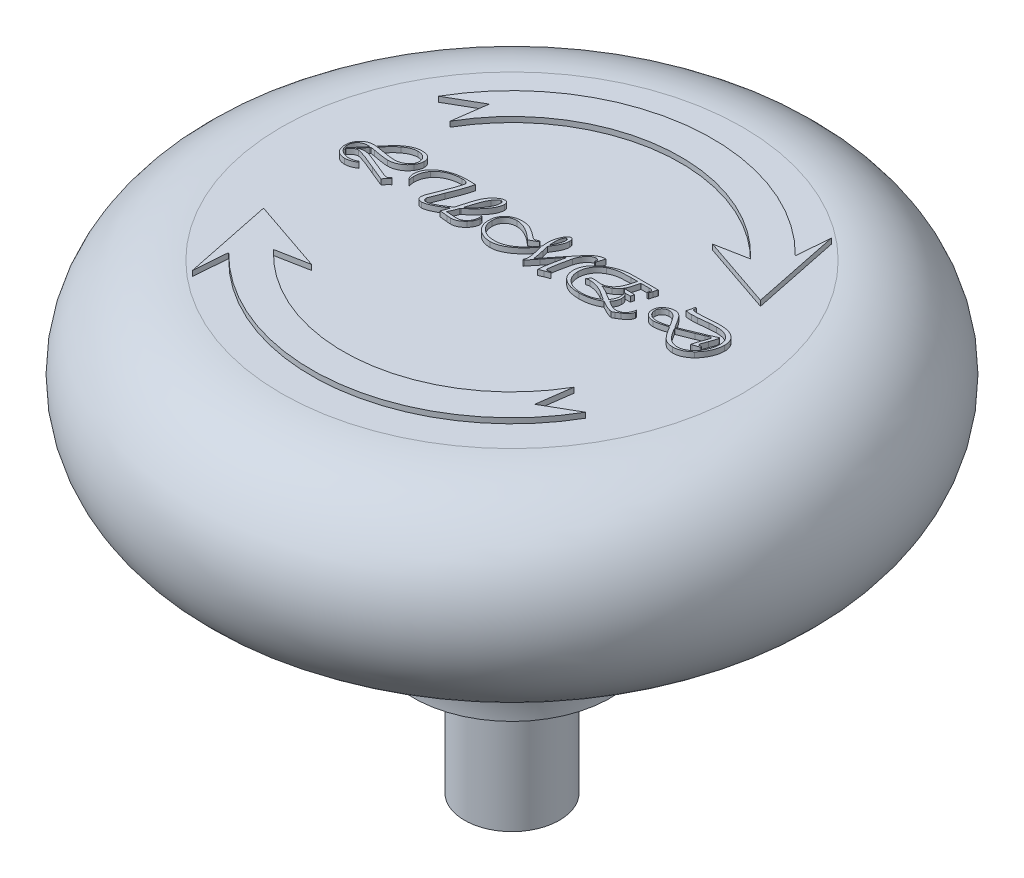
from build123d import *

# Parameters (mm, degrees)
BOSS_EXTRUDE1_DEPTH = 0.254
BOSS_EXTRUDE2_DEPTH = 0.254
CIRPATTERN1_COUNT   = 2


with BuildPart() as part:
    # Sketch1 → Base-Revolve (revolve)
    with BuildSketch(Plane.XY, mode=Mode.PRIVATE) as base_revolve_sk:
        with BuildLine():
            Line((0, 0), (0, 22.225))
            Line((0, 22.225), (11.1125, 22.225))
            ThreePointArc((11.1125, 22.225), (15.875, 17.4625), (11.1125, 12.7))
            ThreePointArc((11.1125, 12.7), (6.622371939, 10.840128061), (4.7625, 6.35))
            Line((4.7625, 6.35), (2.286, 6.35))
            Line((2.286, 6.35), (2.286, 0))
            Line((2.286, 0), (0, 0))
        make_face()
    revolve(base_revolve_sk.sketch.rotate(Axis((0, 0, 0), (0, 1, 0)), 90), axis=Axis((0, 0, 0), (0, 1, 0)))

    # Sketch2 → Boss-Extrude1 (add)
    # profile 1 of 5: a face of its own
    with BuildSketch(Plane(origin=(0, 22.225, 0), x_dir=(1, 0, 0), z_dir=(0, 1, 0))):
        with BuildLine():
            Line((-7.844013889, 1.062302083), (-7.876645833, 1.020409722))
            add(Edge.make_bspline(
                [(-7.876645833, 1.020409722), (-7.903245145, 0.986479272), (-7.954322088, 0.921324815), (-8.030070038, 0.829745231), (-8.101089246, 0.747839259), (-8.147722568, 0.697361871), (-8.169892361, 0.673364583)],
                knots=[0, 0, 0, 0, 1.138248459, 2.185705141, 3.137472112, 4, 4, 4, 4], degree=3))
            add(Edge.make_bspline(
                [(-8.169892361, 0.673364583), (-8.147801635, 0.687077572), (-8.10348868, 0.714585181), (-8.028998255, 0.742057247), (-7.949269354, 0.758700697), (-7.894222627, 0.7608834), (-7.8660625, 0.762)],
                knots=[0, 0, 0, 0, 0.9694179, 1.944606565, 2.948527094, 4, 4, 4, 4], degree=3))
            add(Edge.make_bspline(
                [(-7.8660625, 0.762), (-7.849585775, 0.761646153), (-7.815817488, 0.76092096), (-7.764140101, 0.75526752), (-7.710189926, 0.746606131), (-7.654274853, 0.733369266), (-7.595838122, 0.717788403), (-7.535610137, 0.697480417), (-7.472708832, 0.674881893), (-7.430737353, 0.656972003), (-7.409215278, 0.647788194)],
                knots=[0, 0, 0, 0, 0.834034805, 1.709315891, 2.629358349, 3.5988192, 4.617040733, 5.690185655, 6.815576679, 8, 8, 8, 8], degree=3))
            Line((-7.409215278, 0.647788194), (-7.001315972, 0.480659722))
            Line((-7.001315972, 0.480659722), (-6.578864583, 0.306034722))
            add(Edge.make_bspline(
                [(-6.578864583, 0.306034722), (-6.557866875, 0.297454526), (-6.51817045, 0.28123356), (-6.461609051, 0.259088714), (-6.411374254, 0.240426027), (-6.367446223, 0.225617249), (-6.330157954, 0.213536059), (-6.299439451, 0.204343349), (-6.274756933, 0.199186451), (-6.260349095, 0.198037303), (-6.254309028, 0.197555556)],
                knots=[0, 0, 0, 0, 1.586487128, 2.999273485, 4.248302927, 5.334187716, 6.241295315, 6.989753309, 7.576483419, 8, 8, 8, 8], degree=3))
            add(Edge.make_bspline(
                [(-6.254309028, 0.197555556), (-6.248557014, 0.197997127), (-6.236470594, 0.198924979), (-6.217680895, 0.203478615), (-6.197940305, 0.211616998), (-6.177084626, 0.222879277), (-6.155095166, 0.236992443), (-6.131983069, 0.254412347), (-6.107986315, 0.275205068), (-6.091693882, 0.29025961), (-6.083211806, 0.298097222)],
                knots=[0, 0, 0, 0, 0.682771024, 1.434672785, 2.278745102, 3.20586963, 4.239716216, 5.371729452, 6.631684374, 8, 8, 8, 8], degree=3))
            Line((-6.083211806, 0.298097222), (-6.04440625, 0.257527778))
            add(Edge.make_bspline(
                [(-6.04440625, 0.257527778), (-6.066654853, 0.237155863), (-6.111599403, 0.196002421), (-6.176221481, 0.129572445), (-6.241286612, 0.060457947), (-6.282745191, 0.011509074), (-6.303697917, -0.013229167)],
                knots=[0, 0, 0, 0, 0.964647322, 1.948690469, 2.963289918, 4, 4, 4, 4], degree=3))
            add(Edge.make_bspline(
                [(-6.303697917, -0.013229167), (-6.323864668, -0.005957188), (-6.366836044, 0.009537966), (-6.434702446, 0.035921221), (-6.510774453, 0.065195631), (-6.594185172, 0.099431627), (-6.685712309, 0.136619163), (-6.784339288, 0.178932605), (-6.891203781, 0.224148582), (-6.964884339, 0.256006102), (-7.003079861, 0.272520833)],
                knots=[0, 0, 0, 0, 0.680877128, 1.450815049, 2.312602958, 3.269730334, 4.314453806, 5.450405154, 6.678306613, 8, 8, 8, 8], degree=3))
            add(Edge.make_bspline(
                [(-7.003079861, 0.272520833), (-7.038361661, 0.287651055), (-7.106991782, 0.317082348), (-7.20716677, 0.360232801), (-7.302358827, 0.399505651), (-7.391727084, 0.436983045), (-7.476057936, 0.470174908), (-7.554639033, 0.501191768), (-7.627751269, 0.529512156), (-7.695666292, 0.55465353), (-7.758254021, 0.576823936), (-7.815549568, 0.595605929), (-7.867173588, 0.612175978), (-7.913470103, 0.625523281), (-7.954420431, 0.635579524), (-7.989783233, 0.643315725), (-8.019825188, 0.648189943), (-8.038175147, 0.64882553), (-8.046420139, 0.649111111)],
                knots=[0, 0, 0, 0, 1.656597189, 3.222411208, 4.706677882, 6.100194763, 7.404098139, 8.617324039, 9.745811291, 10.787400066, 11.742314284, 12.610844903, 13.389203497, 14.081871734, 14.689544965, 15.208317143, 15.64428154, 16, 16, 16, 16], degree=3))
            add(Edge.make_bspline(
                [(-8.046420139, 0.649111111), (-8.060424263, 0.648797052), (-8.087622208, 0.648187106), (-8.126452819, 0.640386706), (-8.162136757, 0.628583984), (-8.189471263, 0.613865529), (-8.210688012, 0.598107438), (-8.22916898, 0.583667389), (-8.249987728, 0.565789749), (-8.273321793, 0.544722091), (-8.29871728, 0.51996903), (-8.326650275, 0.492041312), (-8.356926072, 0.460868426), (-8.377765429, 0.438794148), (-8.388614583, 0.427302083)],
                knots=[0, 0, 0, 0, 1.192357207, 2.31572243, 3.362124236, 4.388441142, 4.945031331, 5.614504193, 6.388052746, 7.2842838, 8.294789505, 9.411492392, 10.652399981, 12, 12, 12, 12], degree=3))
            Line((-8.388614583, 0.427302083), (-8.415513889, 0.399520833))
            Line((-8.415513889, 0.399520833), (-8.445059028, 0.447145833))
            add(Edge.make_bspline(
                [(-8.445059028, 0.447145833), (-8.429874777, 0.462979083), (-8.398852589, 0.495327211), (-8.35204312, 0.545827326), (-8.303519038, 0.59904387), (-8.253851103, 0.655493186), (-8.202576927, 0.714755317), (-8.14965061, 0.776805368), (-8.09543087, 0.842213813), (-8.058887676, 0.886920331), (-8.040246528, 0.909725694)],
                knots=[0, 0, 0, 0, 0.856241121, 1.749343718, 2.687543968, 3.667143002, 4.683987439, 5.746253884, 6.850335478, 8, 8, 8, 8], degree=3))
            Line((-8.040246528, 0.909725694), (-7.934413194, 1.038489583))
            add(Edge.make_bspline(
                [(-7.934413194, 1.038489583), (-7.933526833, 1.03966219), (-7.930991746, 1.04301597), (-7.926272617, 1.049696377), (-7.9186427, 1.058864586), (-7.912668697, 1.06583954), (-7.909277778, 1.069798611)],
                knots=[0, 0, 0, 0, 0.439136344, 1.255977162, 2.442458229, 4, 4, 4, 4], degree=3))
            add(Edge.make_bspline(
                [(-7.909277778, 1.069798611), (-7.92308992, 1.070685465), (-7.9486414, 1.072326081), (-7.974244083, 1.072407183), (-7.986006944, 1.072444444)],
                knots=[0, 0, 0, 0, 1.08112269, 2, 2, 2, 2], degree=3))
            add(Edge.make_bspline(
                [(-7.986006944, 1.072444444), (-8.006009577, 1.071983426), (-8.045083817, 1.071082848), (-8.102118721, 1.065170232), (-8.155872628, 1.053831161), (-8.206551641, 1.039044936), (-8.254422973, 1.020015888), (-8.298814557, 0.996158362), (-8.340273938, 0.968183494), (-8.378093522, 0.936051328), (-8.411967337, 0.900327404), (-8.441983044, 0.861660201), (-8.466980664, 0.819829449), (-8.487430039, 0.774960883), (-8.504013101, 0.727536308), (-8.514534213, 0.676654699), (-8.522099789, 0.623173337), (-8.522768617, 0.586374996), (-8.523111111, 0.56753125)],
                knots=[0, 0, 0, 0, 1.153469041, 2.253249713, 3.300465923, 4.31687438, 5.294262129, 6.264975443, 7.217045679, 8.173144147, 9.120373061, 10.051076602, 10.990079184, 11.923018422, 12.890618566, 13.879805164, 14.914287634, 16, 16, 16, 16], degree=3))
            add(Edge.make_bspline(
                [(-8.523111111, 0.56753125), (-8.522638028, 0.55088397), (-8.521707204, 0.518129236), (-8.513273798, 0.470134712), (-8.500779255, 0.423783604), (-8.481919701, 0.379714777), (-8.458520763, 0.33741261), (-8.429439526, 0.297482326), (-8.395220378, 0.259477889), (-8.356392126, 0.223538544), (-8.31330988, 0.191528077), (-8.268350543, 0.16223495), (-8.220187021, 0.138624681), (-8.170169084, 0.118591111), (-8.11748555, 0.103704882), (-8.062817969, 0.092648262), (-8.005725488, 0.085888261), (-7.966916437, 0.085078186), (-7.947201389, 0.084666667)],
                knots=[0, 0, 0, 0, 0.955107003, 1.8792424, 2.790530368, 3.705991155, 4.62417156, 5.561206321, 6.535513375, 7.556939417, 8.593424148, 9.614292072, 10.633448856, 11.667903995, 12.704388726, 13.77205568, 14.868201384, 16, 16, 16, 16], degree=3))
            add(Edge.make_bspline(
                [(-7.947201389, 0.084666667), (-7.932931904, 0.085060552), (-7.903729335, 0.085866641), (-7.859206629, 0.090837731), (-7.81310689, 0.099310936), (-7.76548781, 0.111424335), (-7.71617649, 0.126386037), (-7.665241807, 0.144582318), (-7.61269114, 0.16618572), (-7.577592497, 0.182838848), (-7.559586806, 0.191381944)],
                knots=[0, 0, 0, 0, 0.845002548, 1.729301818, 2.64949702, 3.618456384, 4.637229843, 5.699898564, 6.820042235, 8, 8, 8, 8], degree=3))
            Line((-7.559586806, 0.191381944), (-7.528277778, 0.14684375))
            add(Edge.make_bspline(
                [(-7.528277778, 0.14684375), (-7.54987758, 0.132921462), (-7.592217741, 0.105630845), (-7.6572009, 0.069720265), (-7.722254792, 0.039686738), (-7.787000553, 0.014801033), (-7.851634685, -0.004194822), (-7.915886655, -0.017922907), (-7.980025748, -0.026795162), (-8.022873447, -0.027747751), (-8.044215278, -0.028222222)],
                knots=[0, 0, 0, 0, 1.115340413, 2.186302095, 3.219787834, 4.223534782, 5.194707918, 6.140844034, 7.073980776, 8, 8, 8, 8], degree=3))
            add(Edge.make_bspline(
                [(-8.044215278, -0.028222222), (-8.064084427, -0.027872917), (-8.10278014, -0.027192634), (-8.159253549, -0.019740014), (-8.212801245, -0.00860389), (-8.263272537, 0.007876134), (-8.31072149, 0.028637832), (-8.355204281, 0.053861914), (-8.396470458, 0.084064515), (-8.434282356, 0.118996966), (-8.46850878, 0.157486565), (-8.498435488, 0.199432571), (-8.523656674, 0.244502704), (-8.543898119, 0.292957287), (-8.559899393, 0.344483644), (-8.571091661, 0.399139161), (-8.578518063, 0.456938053), (-8.579203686, 0.496510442), (-8.579555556, 0.516819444)],
                knots=[0, 0, 0, 0, 1.10500787, 2.15203313, 3.164360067, 4.144722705, 5.100655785, 6.042166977, 6.984530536, 7.939728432, 8.901592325, 9.845800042, 10.801558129, 11.76928192, 12.762762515, 13.799093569, 14.870469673, 16, 16, 16, 16], degree=3))
            add(Edge.make_bspline(
                [(-8.579555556, 0.516819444), (-8.578928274, 0.542270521), (-8.577695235, 0.59229936), (-8.569006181, 0.665745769), (-8.553319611, 0.735767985), (-8.532219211, 0.802525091), (-8.505287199, 0.866241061), (-8.471542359, 0.926193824), (-8.432022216, 0.983085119), (-8.386854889, 1.036143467), (-8.336995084, 1.084182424), (-8.283798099, 1.12669898), (-8.226861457, 1.162106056), (-8.166875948, 1.191285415), (-8.103564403, 1.213935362), (-8.037245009, 1.230214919), (-7.967642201, 1.240178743), (-7.920188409, 1.241238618), (-7.896048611, 1.241777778)],
                knots=[0, 0, 0, 0, 1.095692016, 2.153787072, 3.17789712, 4.180588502, 5.16443081, 6.150346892, 7.136932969, 8.142515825, 9.145027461, 10.113588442, 11.068805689, 12.025447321, 12.980266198, 13.957963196, 14.96121358, 16, 16, 16, 16], degree=3))
            add(Edge.make_bspline(
                [(-7.896048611, 1.241777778), (-7.878542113, 1.241600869), (-7.843766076, 1.241249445), (-7.809162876, 1.237772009), (-7.791979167, 1.236045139)],
                knots=[0, 0, 0, 0, 1.006813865, 2, 2, 2, 2], degree=3))
            Line((-7.791979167, 1.236045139), (-7.773899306, 1.232958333))
            Line((-7.773899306, 1.232958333), (-7.735534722, 1.283670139))
            add(Edge.make_bspline(
                [(-7.735534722, 1.283670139), (-7.70590633, 1.320591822), (-7.648286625, 1.392395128), (-7.560598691, 1.494429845), (-7.475430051, 1.588792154), (-7.391806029, 1.675045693), (-7.310397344, 1.753683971), (-7.230776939, 1.824320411), (-7.152848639, 1.886768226), (-7.076699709, 1.942041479), (-7.000989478, 1.989904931), (-6.925188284, 2.0312921), (-6.848821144, 2.066125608), (-6.772005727, 2.095067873), (-6.694528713, 2.117133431), (-6.616702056, 2.132989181), (-6.538421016, 2.14322313), (-6.485997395, 2.144333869), (-6.459802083, 2.144888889)],
                knots=[0, 0, 0, 0, 1.425924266, 2.773060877, 4.052013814, 5.254437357, 6.391175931, 7.460845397, 8.459381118, 9.398242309, 10.293764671, 11.155652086, 11.997749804, 12.820189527, 13.626061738, 14.421490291, 15.211241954, 16, 16, 16, 16], degree=3))
            add(Edge.make_bspline(
                [(-6.459802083, 2.144888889), (-6.441712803, 2.144524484), (-6.406496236, 2.143815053), (-6.355172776, 2.13906218), (-6.307004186, 2.130612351), (-6.261631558, 2.119286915), (-6.219327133, 2.104223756), (-6.179729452, 2.086249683), (-6.143468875, 2.064483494), (-6.110208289, 2.039686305), (-6.08031267, 2.012197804), (-6.054411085, 1.981732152), (-6.032364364, 1.9490678), (-6.013777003, 1.913895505), (-6.00065671, 1.875825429), (-5.990032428, 1.835820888), (-5.98456053, 1.79314202), (-5.983602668, 1.763901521), (-5.983111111, 1.748895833)],
                knots=[0, 0, 0, 0, 1.2398372, 2.413739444, 3.528434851, 4.588908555, 5.614941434, 6.602154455, 7.56453417, 8.507523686, 9.441428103, 10.341856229, 11.241607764, 12.138308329, 13.059298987, 13.995157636, 14.971151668, 16, 16, 16, 16], degree=3))
            add(Edge.make_bspline(
                [(-5.983111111, 1.748895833), (-5.983425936, 1.734765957), (-5.984061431, 1.706243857), (-5.990113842, 1.663157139), (-5.999947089, 1.619436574), (-6.013239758, 1.574958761), (-6.02986419, 1.529667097), (-6.051500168, 1.484326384), (-6.076080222, 1.437886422), (-6.094800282, 1.407338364), (-6.104378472, 1.391708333)],
                knots=[0, 0, 0, 0, 0.886693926, 1.789850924, 2.72574777, 3.698062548, 4.702558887, 5.751230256, 6.849408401, 8, 8, 8, 8], degree=3))
            add(Edge.make_bspline(
                [(-6.104378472, 1.391708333), (-6.11590195, 1.374196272), (-6.138775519, 1.33943564), (-6.177095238, 1.290476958), (-6.217497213, 1.244017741), (-6.261119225, 1.20074692), (-6.306725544, 1.159762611), (-6.355141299, 1.121558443), (-6.406143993, 1.086412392), (-6.459554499, 1.054370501), (-6.514204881, 1.025066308), (-6.570569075, 1.000812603), (-6.626766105, 0.978679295), (-6.684244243, 0.961691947), (-6.74216042, 0.947669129), (-6.801082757, 0.938973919), (-6.860336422, 0.932046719), (-6.900165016, 0.931571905), (-6.920177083, 0.931333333)],
                knots=[0, 0, 0, 0, 1.029904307, 2.044312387, 3.052838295, 4.054067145, 5.06197188, 6.064997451, 7.082974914, 8.103870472, 9.125047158, 10.127760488, 11.117903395, 12.09148894, 13.071033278, 14.043760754, 15.017078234, 16, 16, 16, 16], degree=3))
            add(Edge.make_bspline(
                [(-6.920177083, 0.931333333), (-6.94003028, 0.931557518), (-6.982729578, 0.932039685), (-7.051068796, 0.937643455), (-7.128324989, 0.9447769), (-7.214382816, 0.956369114), (-7.309407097, 0.969763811), (-7.413300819, 0.986798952), (-7.52592949, 1.006504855), (-7.603852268, 1.02147005), (-7.644253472, 1.029229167)],
                knots=[0, 0, 0, 0, 0.651191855, 1.400551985, 2.248453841, 3.196528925, 4.248851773, 5.396848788, 6.650324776, 8, 8, 8, 8], degree=3))
            add(Edge.make_bspline(
                [(-7.644253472, 1.029229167), (-7.664669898, 1.033138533), (-7.702959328, 1.040470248), (-7.756688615, 1.049423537), (-7.80272051, 1.057513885), (-7.831062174, 1.06080026), (-7.844013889, 1.062302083)],
                knots=[0, 0, 0, 0, 1.231613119, 2.309795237, 3.227601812, 4, 4, 4, 4], degree=3))
        make_face()
        with BuildLine():
            add(Edge.make_bspline(
                [(-7.706871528, 1.227225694), (-7.685547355, 1.22450903), (-7.639311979, 1.218618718), (-7.564669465, 1.207339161), (-7.479069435, 1.193803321), (-7.418458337, 1.183085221), (-7.386284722, 1.177395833)],
                knots=[0, 0, 0, 0, 0.794982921, 1.723693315, 2.791689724, 4, 4, 4, 4], degree=3))
            add(Edge.make_bspline(
                [(-7.386284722, 1.177395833), (-7.351761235, 1.171253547), (-7.285284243, 1.159426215), (-7.189229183, 1.144244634), (-7.101098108, 1.130656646), (-7.02074558, 1.120466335), (-6.948388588, 1.110992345), (-6.883629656, 1.105565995), (-6.826736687, 1.101674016), (-6.791418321, 1.100985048), (-6.775097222, 1.100666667)],
                knots=[0, 0, 0, 0, 1.364865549, 2.628128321, 3.785232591, 4.835562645, 5.780842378, 6.62518719, 7.364680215, 8, 8, 8, 8], degree=3))
            add(Edge.make_bspline(
                [(-6.775097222, 1.100666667), (-6.752738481, 1.101237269), (-6.708791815, 1.102358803), (-6.643849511, 1.109378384), (-6.58107142, 1.121880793), (-6.520240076, 1.138920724), (-6.461686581, 1.161124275), (-6.405396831, 1.188233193), (-6.35107589, 1.220012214), (-6.299531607, 1.256218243), (-6.252297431, 1.295906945), (-6.210721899, 1.337871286), (-6.174967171, 1.381129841), (-6.145994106, 1.426397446), (-6.123727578, 1.473578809), (-6.10789246, 1.52232486), (-6.097599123, 1.572664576), (-6.096536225, 1.606852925), (-6.096, 1.624100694)],
                knots=[0, 0, 0, 0, 1.135441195, 2.231738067, 3.312062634, 4.382465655, 5.436054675, 6.487685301, 7.551509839, 8.628347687, 9.682491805, 10.680044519, 11.6243168, 12.527114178, 13.401922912, 14.265836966, 15.125127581, 16, 16, 16, 16], degree=3))
            add(Edge.make_bspline(
                [(-6.096, 1.624100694), (-6.096495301, 1.639253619), (-6.097465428, 1.66893308), (-6.102944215, 1.712329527), (-6.11343399, 1.753119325), (-6.126883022, 1.791918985), (-6.145095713, 1.828144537), (-6.167412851, 1.861928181), (-6.193453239, 1.893428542), (-6.223654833, 1.921881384), (-6.25659365, 1.948138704), (-6.292876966, 1.970399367), (-6.331590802, 1.989743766), (-6.373267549, 2.004867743), (-6.41738539, 2.017544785), (-6.46457642, 2.025517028), (-6.514202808, 2.031073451), (-6.548273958, 2.031687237), (-6.565635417, 2.032)],
                knots=[0, 0, 0, 0, 1.037186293, 2.031497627, 2.985305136, 3.914235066, 4.836333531, 5.751328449, 6.67982267, 7.625962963, 8.585744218, 9.556998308, 10.533083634, 11.541939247, 12.586415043, 13.669546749, 14.812483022, 16, 16, 16, 16], degree=3))
            add(Edge.make_bspline(
                [(-6.565635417, 2.032), (-6.588015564, 2.031288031), (-6.633602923, 2.029837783), (-6.702759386, 2.018763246), (-6.77337011, 2.000493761), (-6.84546489, 1.975175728), (-6.918971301, 1.942509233), (-6.994391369, 1.903322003), (-7.071179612, 1.856439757), (-7.121462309, 1.820926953), (-7.147277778, 1.802694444)],
                knots=[0, 0, 0, 0, 0.845185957, 1.721605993, 2.638751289, 3.597593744, 4.604541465, 5.674969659, 6.806314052, 8, 8, 8, 8], degree=3))
            add(Edge.make_bspline(
                [(-7.147277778, 1.802694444), (-7.166069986, 1.78844706), (-7.20523136, 1.758756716), (-7.263992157, 1.709067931), (-7.324954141, 1.652628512), (-7.388759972, 1.589662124), (-7.454962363, 1.520014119), (-7.524502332, 1.444238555), (-7.595609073, 1.361048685), (-7.643730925, 1.303273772), (-7.668506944, 1.273527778)],
                knots=[0, 0, 0, 0, 0.760053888, 1.58388805, 2.479177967, 3.437388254, 4.472897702, 5.576292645, 6.752129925, 8, 8, 8, 8], degree=3))
            Line((-7.668506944, 1.273527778), (-7.706871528, 1.227225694))
        make_face(mode=Mode.SUBTRACT)
    # profile 2 of 5: a face of its own
    with BuildSketch(Plane(origin=(0, 22.225, 0), x_dir=(1, 0, 0), z_dir=(0, 1, 0))):
        with BuildLine():
            add(Edge.make_bspline(
                [(-3.165739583, 0.649552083), (-3.178988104, 0.610589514), (-3.205482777, 0.532671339), (-3.252748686, 0.418773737), (-3.304125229, 0.306601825), (-3.34265112, 0.233977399), (-3.361972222, 0.197555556)],
                knots=[0, 0, 0, 0, 1.000606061, 2.001033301, 2.997499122, 4, 4, 4, 4], degree=3))
            add(Edge.make_bspline(
                [(-3.361972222, 0.197555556), (-3.35153588, 0.197555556), (-3.335072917, 0.197555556), (-3.318609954, 0.197555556), (-3.312583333, 0.197555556)],
                knots=[0, 0, 0, 0, 1.267857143, 2, 2, 2, 2], degree=3))
            add(Edge.make_bspline(
                [(-3.312583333, 0.197555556), (-3.294500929, 0.197360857), (-3.255673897, 0.196942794), (-3.193631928, 0.194077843), (-3.123655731, 0.189648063), (-3.07445193, 0.185589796), (-3.048440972, 0.183444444)],
                knots=[0, 0, 0, 0, 0.820090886, 1.760921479, 2.816339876, 4, 4, 4, 4], degree=3))
            add(Edge.make_bspline(
                [(-3.048440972, 0.183444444), (-3.035648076, 0.18247263), (-3.011376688, 0.18062885), (-2.976891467, 0.177125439), (-2.945967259, 0.175353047), (-2.918826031, 0.172696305), (-2.895407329, 0.171816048), (-2.875896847, 0.170031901), (-2.860141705, 0.169884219), (-2.850884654, 0.169498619), (-2.846916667, 0.169333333)],
                knots=[0, 0, 0, 0, 1.523917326, 2.891260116, 4.116564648, 5.20259081, 6.129444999, 6.899462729, 7.52826038, 8, 8, 8, 8], degree=3))
            add(Edge.make_bspline(
                [(-2.846916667, 0.169333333), (-2.828213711, 0.169776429), (-2.791493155, 0.170646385), (-2.737711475, 0.179450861), (-2.686381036, 0.192992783), (-2.637324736, 0.212075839), (-2.590878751, 0.237056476), (-2.546602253, 0.267101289), (-2.504813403, 0.302787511), (-2.466025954, 0.343582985), (-2.430448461, 0.388200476), (-2.399369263, 0.436246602), (-2.37288897, 0.487003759), (-2.351069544, 0.540531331), (-2.334938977, 0.59694988), (-2.323123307, 0.655783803), (-2.315171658, 0.717392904), (-2.314543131, 0.759475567), (-2.314222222, 0.780961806)],
                knots=[0, 0, 0, 0, 0.990773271, 1.94524047, 2.880912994, 3.80127348, 4.728601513, 5.670967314, 6.632849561, 7.635957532, 8.650951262, 9.653877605, 10.66467465, 11.681969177, 12.712783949, 13.770350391, 14.861602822, 16, 16, 16, 16], degree=3))
            add(Edge.make_bspline(
                [(-2.314222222, 0.780961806), (-2.314429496, 0.786995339), (-2.314901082, 0.800722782), (-2.317919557, 0.823335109), (-2.321639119, 0.850480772), (-2.325699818, 0.869767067), (-2.327892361, 0.880180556)],
                knots=[0, 0, 0, 0, 0.721986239, 1.642656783, 2.727170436, 4, 4, 4, 4], degree=3))
            add(Edge.make_bspline(
                [(-2.327892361, 0.880180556), (-2.316965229, 0.870118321), (-2.295267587, 0.850138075), (-2.273703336, 0.810305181), (-2.259908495, 0.765273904), (-2.258509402, 0.733010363), (-2.257777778, 0.716138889)],
                knots=[0, 0, 0, 0, 0.960397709, 1.90702986, 2.905529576, 4, 4, 4, 4], degree=3))
            add(Edge.make_bspline(
                [(-2.257777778, 0.716138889), (-2.258392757, 0.698316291), (-2.259635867, 0.662289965), (-2.269233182, 0.608242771), (-2.285209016, 0.554317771), (-2.307799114, 0.500450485), (-2.335885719, 0.446320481), (-2.370661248, 0.392236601), (-2.411903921, 0.33832813), (-2.442894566, 0.303627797), (-2.458861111, 0.28575)],
                knots=[0, 0, 0, 0, 0.879065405, 1.776929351, 2.699499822, 3.649072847, 4.654714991, 5.704955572, 6.817580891, 8, 8, 8, 8], degree=3))
            add(Edge.make_bspline(
                [(-2.458861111, 0.28575), (-2.478618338, 0.265208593), (-2.517124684, 0.225173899), (-2.580015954, 0.173157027), (-2.643857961, 0.127906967), (-2.710354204, 0.091892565), (-2.778261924, 0.06292612), (-2.848307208, 0.043554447), (-2.919910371, 0.030271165), (-2.968417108, 0.028909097), (-2.992878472, 0.028222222)],
                knots=[0, 0, 0, 0, 1.119071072, 2.18104187, 3.20169996, 4.189097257, 5.147014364, 6.095903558, 7.039787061, 8, 8, 8, 8], degree=3))
            add(Edge.make_bspline(
                [(-2.992878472, 0.028222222), (-3.006554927, 0.028369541), (-3.035556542, 0.028681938), (-3.081248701, 0.032301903), (-3.131738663, 0.036356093), (-3.166784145, 0.040857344), (-3.185142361, 0.043215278)],
                knots=[0, 0, 0, 0, 0.850304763, 1.803114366, 2.849183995, 4, 4, 4, 4], degree=3))
            add(Edge.make_bspline(
                [(-3.185142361, 0.043215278), (-3.206154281, 0.045926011), (-3.246388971, 0.05111666), (-3.304052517, 0.057519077), (-3.356049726, 0.063474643), (-3.402671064, 0.067809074), (-3.44382851, 0.071376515), (-3.479550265, 0.073962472), (-3.509673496, 0.076057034), (-3.527922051, 0.076216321), (-3.53615625, 0.076288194)],
                knots=[0, 0, 0, 0, 1.441533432, 2.760321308, 3.947666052, 5.002599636, 5.946160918, 6.75852058, 7.439813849, 8, 8, 8, 8], degree=3))
            add(Edge.make_bspline(
                [(-3.53615625, 0.076288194), (-3.521011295, 0.11371077), (-3.492080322, 0.185198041), (-3.453224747, 0.288000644), (-3.42117414, 0.381251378), (-3.403399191, 0.440477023), (-3.395045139, 0.4683125)],
                knots=[0, 0, 0, 0, 1.162156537, 2.220034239, 3.163433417, 4, 4, 4, 4], degree=3))
            add(Edge.make_bspline(
                [(-3.395045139, 0.4683125), (-3.399585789, 0.465057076), (-3.407639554, 0.459282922), (-3.418620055, 0.451829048), (-3.426290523, 0.445592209), (-3.430755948, 0.442284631), (-3.432527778, 0.440972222)],
                knots=[0, 0, 0, 0, 1.444988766, 2.562980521, 3.429807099, 4, 4, 4, 4], degree=3))
            Line((-3.432527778, 0.440972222), (-3.563055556, 0.348368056))
            add(Edge.make_bspline(
                [(-3.563055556, 0.348368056), (-3.596158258, 0.325469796), (-3.663043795, 0.279202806), (-3.769459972, 0.216584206), (-3.880859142, 0.157128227), (-3.977550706, 0.112979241), (-4.054412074, 0.080200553), (-4.108855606, 0.058685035), (-4.160090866, 0.041318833), (-4.207429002, 0.02608943), (-4.25139108, 0.014333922), (-4.291794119, 0.006556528), (-4.328739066, 0.001231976), (-4.352233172, 0.000397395), (-4.363420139, 0)],
                knots=[0, 0, 0, 0, 1.642685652, 3.319122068, 5.03710022, 6.795679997, 7.656108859, 8.448408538, 9.184714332, 9.864148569, 10.478365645, 11.040899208, 11.543314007, 12, 12, 12, 12], degree=3))
            add(Edge.make_bspline(
                [(-4.363420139, 0), (-4.380380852, 0.000642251), (-4.412869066, 0.001872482), (-4.458962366, 0.012149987), (-4.500094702, 0.028974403), (-4.53550266, 0.052846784), (-4.564319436, 0.082240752), (-4.585338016, 0.116393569), (-4.59819832, 0.154622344), (-4.599537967, 0.181580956), (-4.600222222, 0.195350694)],
                knots=[0, 0, 0, 0, 1.182021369, 2.264159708, 3.275329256, 4.265007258, 5.222174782, 6.124322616, 7.041954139, 8, 8, 8, 8], degree=3))
            add(Edge.make_bspline(
                [(-4.600222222, 0.195350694), (-4.599800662, 0.205947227), (-4.598895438, 0.228701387), (-4.593722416, 0.265109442), (-4.585108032, 0.306095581), (-4.573605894, 0.351837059), (-4.559047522, 0.402187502), (-4.540758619, 0.456980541), (-4.519152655, 0.516332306), (-4.503148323, 0.557275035), (-4.494829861, 0.578555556)],
                knots=[0, 0, 0, 0, 0.637230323, 1.368338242, 2.207135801, 3.15444678, 4.203199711, 5.357306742, 6.626425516, 8, 8, 8, 8], degree=3))
            Line((-4.494829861, 0.578555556), (-4.335197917, 0.979840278))
            add(Edge.make_bspline(
                [(-4.335197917, 0.979840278), (-4.324337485, 1.007481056), (-4.303195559, 1.06128916), (-4.271989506, 1.139888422), (-4.243694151, 1.214555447), (-4.216820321, 1.284958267), (-4.192950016, 1.351446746), (-4.170141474, 1.413407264), (-4.150369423, 1.471601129), (-4.132335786, 1.525369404), (-4.116399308, 1.575227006), (-4.102062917, 1.620651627), (-4.090928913, 1.662284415), (-4.080650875, 1.699417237), (-4.073948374, 1.732666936), (-4.068524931, 1.761738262), (-4.064481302, 1.786559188), (-4.064149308, 1.801947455), (-4.064, 1.808868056)],
                knots=[0, 0, 0, 0, 1.629966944, 3.173044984, 4.64136338, 6.012397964, 7.308893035, 8.518543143, 9.636009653, 10.681996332, 11.631092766, 12.508938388, 13.29576351, 13.996295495, 14.622870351, 15.156123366, 15.620481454, 16, 16, 16, 16], degree=3))
            add(Edge.make_bspline(
                [(-4.064, 1.808868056), (-4.06474895, 1.819903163), (-4.066197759, 1.841250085), (-4.080647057, 1.870891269), (-4.104328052, 1.894963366), (-4.136181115, 1.915226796), (-4.177081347, 1.92952838), (-4.226289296, 1.939798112), (-4.284170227, 1.946312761), (-4.32577182, 1.946978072), (-4.347986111, 1.947333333)],
                knots=[0, 0, 0, 0, 0.751786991, 1.454298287, 2.202097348, 3.039903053, 4.017929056, 5.151436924, 6.478933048, 8, 8, 8, 8], degree=3))
            add(Edge.make_bspline(
                [(-4.347986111, 1.947333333), (-4.375483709, 1.947034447), (-4.429952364, 1.946442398), (-4.51089906, 1.940492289), (-4.590387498, 1.930888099), (-4.668350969, 1.917114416), (-4.744934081, 1.899985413), (-4.820021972, 1.878806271), (-4.893647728, 1.853481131), (-4.965679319, 1.825262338), (-5.034668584, 1.792894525), (-5.100626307, 1.758382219), (-5.162219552, 1.720056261), (-5.220994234, 1.680264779), (-5.274920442, 1.636373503), (-5.32561966, 1.590348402), (-5.372529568, 1.541569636), (-5.400687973, 1.506574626), (-5.414697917, 1.489163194)],
                knots=[0, 0, 0, 0, 1.099247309, 2.177445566, 3.243174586, 4.299234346, 5.341467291, 6.379616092, 7.416666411, 8.453433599, 9.470983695, 10.462122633, 11.427738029, 12.369981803, 13.297912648, 14.204798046, 15.106814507, 16, 16, 16, 16], degree=3))
            add(Edge.make_bspline(
                [(-5.414697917, 1.489163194), (-5.430827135, 1.467089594), (-5.462939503, 1.423142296), (-5.503697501, 1.352861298), (-5.538339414, 1.279940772), (-5.567050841, 1.204663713), (-5.589379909, 1.126490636), (-5.604298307, 1.045686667), (-5.61469362, 0.962323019), (-5.615707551, 0.905789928), (-5.616222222, 0.87709375)],
                knots=[0, 0, 0, 0, 0.999165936, 1.989283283, 2.965441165, 3.948765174, 4.932236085, 5.933727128, 6.951160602, 8, 8, 8, 8], degree=3))
            add(Edge.make_bspline(
                [(-5.616222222, 0.87709375), (-5.615563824, 0.858539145), (-5.614140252, 0.818420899), (-5.603393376, 0.754065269), (-5.587101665, 0.681084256), (-5.57241475, 0.629929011), (-5.564628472, 0.602809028)],
                knots=[0, 0, 0, 0, 0.795139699, 1.719228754, 2.790847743, 4, 4, 4, 4], degree=3))
            add(Edge.make_bspline(
                [(-5.564628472, 0.602809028), (-5.577739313, 0.613789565), (-5.603886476, 0.635688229), (-5.637207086, 0.67443532), (-5.665907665, 0.716844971), (-5.689290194, 0.763382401), (-5.707479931, 0.814168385), (-5.720032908, 0.868942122), (-5.727617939, 0.927740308), (-5.72860261, 0.968204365), (-5.729111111, 0.989100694)],
                knots=[0, 0, 0, 0, 0.941137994, 1.876926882, 2.804828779, 3.757608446, 4.738988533, 5.770570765, 6.848684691, 8, 8, 8, 8], degree=3))
            add(Edge.make_bspline(
                [(-5.729111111, 0.989100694), (-5.72872847, 1.009113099), (-5.727966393, 1.048970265), (-5.720570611, 1.108082), (-5.709094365, 1.166148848), (-5.693256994, 1.223289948), (-5.672398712, 1.279243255), (-5.647167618, 1.334290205), (-5.617083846, 1.388006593), (-5.582582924, 1.440593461), (-5.543780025, 1.491675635), (-5.500870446, 1.540974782), (-5.454449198, 1.588940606), (-5.403724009, 1.634687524), (-5.348822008, 1.678404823), (-5.290082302, 1.720098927), (-5.227887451, 1.760721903), (-5.183937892, 1.785034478), (-5.161579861, 1.797402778)],
                knots=[0, 0, 0, 0, 0.924408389, 1.841073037, 2.74825116, 3.657968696, 4.577798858, 5.504799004, 6.45351896, 7.4199938, 8.409001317, 9.415419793, 10.438569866, 11.491762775, 12.56955154, 13.679751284, 14.819642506, 16, 16, 16, 16], degree=3))
            add(Edge.make_bspline(
                [(-5.161579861, 1.797402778), (-5.122306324, 1.817660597), (-5.044662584, 1.857710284), (-4.924465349, 1.907517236), (-4.803209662, 1.948267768), (-4.700273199, 1.974363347), (-4.616068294, 1.991720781), (-4.549334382, 2.001974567), (-4.479347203, 2.011189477), (-4.406167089, 2.019335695), (-4.329670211, 2.024897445), (-4.249971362, 2.028691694), (-4.166913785, 2.031553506), (-4.110451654, 2.031849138), (-4.081638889, 2.032)],
                knots=[0, 0, 0, 0, 1.422585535, 2.812450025, 4.185110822, 5.538711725, 6.22939902, 6.953148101, 7.712330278, 8.502717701, 9.323943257, 10.181787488, 11.072161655, 12, 12, 12, 12], degree=3))
            add(Edge.make_bspline(
                [(-4.081638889, 2.032), (-4.054590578, 2.031813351), (-4.001954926, 2.031450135), (-3.925217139, 2.029141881), (-3.85284711, 2.025946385), (-3.806168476, 2.022004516), (-3.783541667, 2.02009375)],
                knots=[0, 0, 0, 0, 1.087623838, 2.11650146, 3.087000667, 4, 4, 4, 4], degree=3))
            add(Edge.make_bspline(
                [(-3.783541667, 2.02009375), (-3.787172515, 2.004061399), (-3.794646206, 1.971060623), (-3.807079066, 1.920181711), (-3.820916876, 1.866548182), (-3.837700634, 1.810459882), (-3.855082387, 1.751394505), (-3.874536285, 1.689664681), (-3.895873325, 1.625385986), (-3.918066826, 1.558151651), (-3.94322951, 1.488595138), (-3.968710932, 1.415825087), (-3.997469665, 1.340869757), (-4.026720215, 1.262797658), (-4.058102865, 1.182123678), (-4.091289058, 1.098676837), (-4.125904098, 1.012447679), (-4.150077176, 0.954239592), (-4.162336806, 0.92471875)],
                knots=[0, 0, 0, 0, 0.679977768, 1.399657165, 2.166565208, 2.970886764, 3.821193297, 4.713507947, 5.647999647, 6.622864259, 7.642132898, 8.707617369, 9.81211846, 10.962882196, 12.156416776, 13.392797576, 14.677729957, 16, 16, 16, 16], degree=3))
            add(Edge.make_bspline(
                [(-4.162336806, 0.92471875), (-4.17542931, 0.892972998), (-4.200334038, 0.832585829), (-4.235611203, 0.746595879), (-4.266940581, 0.669874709), (-4.294264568, 0.602399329), (-4.317789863, 0.54410446), (-4.337018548, 0.494939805), (-4.352551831, 0.45514371), (-4.36762778, 0.41569263), (-4.381192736, 0.374881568), (-4.393414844, 0.331580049), (-4.401128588, 0.29366878), (-4.40218534, 0.270049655), (-4.402666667, 0.259291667)],
                knots=[0, 0, 0, 0, 1.74169775, 3.313079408, 4.714149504, 5.944914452, 7.005383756, 7.902507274, 8.622440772, 9.17216848, 10.044476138, 10.80232251, 11.454484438, 12, 12, 12, 12], degree=3))
            add(Edge.make_bspline(
                [(-4.402666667, 0.259291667), (-4.402402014, 0.247768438), (-4.401903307, 0.226054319), (-4.394035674, 0.195923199), (-4.382293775, 0.16981341), (-4.364631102, 0.148704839), (-4.342193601, 0.132322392), (-4.3150264, 0.120966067), (-4.283234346, 0.113812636), (-4.260422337, 0.113208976), (-4.248326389, 0.112888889)],
                knots=[0, 0, 0, 0, 1.131616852, 2.132394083, 3.045553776, 3.92979093, 4.81010789, 5.756853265, 6.810583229, 8, 8, 8, 8], degree=3))
            add(Edge.make_bspline(
                [(-4.248326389, 0.112888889), (-4.234920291, 0.113636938), (-4.206129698, 0.11524343), (-4.160432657, 0.124089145), (-4.109820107, 0.13916745), (-4.053667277, 0.15882805), (-3.992955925, 0.185463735), (-3.926555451, 0.216638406), (-3.855439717, 0.254290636), (-3.806693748, 0.281946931), (-3.781336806, 0.296333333)],
                knots=[0, 0, 0, 0, 0.636182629, 1.366249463, 2.200199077, 3.139371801, 4.185516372, 5.342292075, 6.617499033, 8, 8, 8, 8], degree=3))
            add(Edge.make_bspline(
                [(-3.781336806, 0.296333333), (-3.758550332, 0.309704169), (-3.714391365, 0.335616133), (-3.650189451, 0.373404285), (-3.590771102, 0.410058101), (-3.535814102, 0.444782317), (-3.485142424, 0.477556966), (-3.439064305, 0.508637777), (-3.397456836, 0.538202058), (-3.371629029, 0.557769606), (-3.359326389, 0.567090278)],
                knots=[0, 0, 0, 0, 1.263799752, 2.44917635, 3.56345707, 4.60318891, 5.558827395, 6.450058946, 7.261711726, 8, 8, 8, 8], degree=3))
            add(Edge.make_bspline(
                [(-3.359326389, 0.567090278), (-3.354769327, 0.581201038), (-3.345283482, 0.61057358), (-3.33043091, 0.656593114), (-3.315932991, 0.706810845), (-3.299150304, 0.760676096), (-3.282638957, 0.818668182), (-3.265504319, 0.880797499), (-3.24686165, 0.946534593), (-3.234627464, 0.99187951), (-3.228357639, 1.015118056)],
                knots=[0, 0, 0, 0, 0.762339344, 1.586863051, 2.485837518, 3.449234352, 4.487243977, 5.585480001, 6.762597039, 8, 8, 8, 8], degree=3))
            add(Edge.make_bspline(
                [(-3.228357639, 1.015118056), (-3.220978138, 1.042931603), (-3.206571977, 1.097228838), (-3.183582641, 1.175973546), (-3.160683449, 1.250077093), (-3.137917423, 1.319436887), (-3.114492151, 1.383774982), (-3.091092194, 1.443463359), (-3.067858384, 1.498527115), (-3.036887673, 1.565482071), (-2.994536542, 1.643440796), (-2.936305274, 1.730467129), (-2.872112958, 1.81258499), (-2.8233182, 1.86180062), (-2.798850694, 1.886479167)],
                knots=[0, 0, 0, 0, 1.051876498, 2.053459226, 2.998426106, 3.887101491, 4.721693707, 5.500988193, 6.230530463, 6.906050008, 8.197274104, 9.468487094, 10.730605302, 12, 12, 12, 12], degree=3))
            add(Edge.make_bspline(
                [(-2.798850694, 1.886479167), (-2.781537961, 1.902410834), (-2.74814078, 1.933143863), (-2.696840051, 1.974389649), (-2.646578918, 2.009300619), (-2.597578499, 2.038381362), (-2.549317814, 2.060825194), (-2.501717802, 2.076123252), (-2.455354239, 2.086682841), (-2.424518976, 2.087866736), (-2.409472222, 2.088444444)],
                knots=[0, 0, 0, 0, 1.257542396, 2.425865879, 3.515765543, 4.526563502, 5.468913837, 6.353570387, 7.196587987, 8, 8, 8, 8], degree=3))
            add(Edge.make_bspline(
                [(-2.409472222, 2.088444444), (-2.397525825, 2.087828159), (-2.374921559, 2.086662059), (-2.342933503, 2.078585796), (-2.316355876, 2.063048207), (-2.294263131, 2.04200823), (-2.277565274, 2.014923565), (-2.265544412, 1.982132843), (-2.258793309, 1.94363987), (-2.258128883, 1.916051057), (-2.257777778, 1.901472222)],
                knots=[0, 0, 0, 0, 1.042473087, 1.972505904, 2.845643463, 3.698105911, 4.608756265, 5.594736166, 6.728979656, 8, 8, 8, 8], degree=3))
            add(Edge.make_bspline(
                [(-2.257777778, 1.901472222), (-2.25850697, 1.881292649), (-2.259995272, 1.840105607), (-2.270899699, 1.777398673), (-2.287477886, 1.712524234), (-2.311851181, 1.645779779), (-2.342199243, 1.576826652), (-2.380287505, 1.506188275), (-2.424245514, 1.433070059), (-2.475279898, 1.357930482), (-2.533076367, 1.280920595), (-2.597737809, 1.201974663), (-2.668811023, 1.120690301), (-2.747010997, 1.037548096), (-2.831750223, 0.951864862), (-2.923442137, 0.86431699), (-3.021891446, 0.77472152), (-3.090500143, 0.715259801), (-3.125611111, 0.684829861)],
                knots=[0, 0, 0, 0, 0.631945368, 1.289817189, 1.988988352, 2.727453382, 3.512949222, 4.347249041, 5.239648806, 6.184774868, 7.191405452, 8.25509645, 9.380962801, 10.57335513, 11.830247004, 13.155825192, 14.544474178, 16, 16, 16, 16], degree=3))
            Line((-3.125611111, 0.684829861), (-3.165739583, 0.649552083))
        make_face()
        with BuildLine():
            add(Edge.make_bspline(
                [(-3.130020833, 0.758472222), (-3.104714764, 0.778402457), (-3.054354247, 0.818064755), (-2.982100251, 0.881042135), (-2.912209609, 0.945719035), (-2.845726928, 1.013129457), (-2.782435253, 1.083117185), (-2.722159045, 1.155485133), (-2.664229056, 1.229758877), (-2.610612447, 1.306080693), (-2.561117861, 1.38153693), (-2.518406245, 1.45549614), (-2.481331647, 1.525804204), (-2.451770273, 1.593708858), (-2.427958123, 1.658203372), (-2.411710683, 1.720100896), (-2.400616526, 1.778775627), (-2.399451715, 1.817200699), (-2.398888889, 1.835767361)],
                knots=[0, 0, 0, 0, 1.15715175, 2.302797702, 3.442500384, 4.577752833, 5.703172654, 6.831710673, 7.960952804, 9.086273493, 10.181958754, 11.201881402, 12.153784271, 13.035870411, 13.861108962, 14.620743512, 15.3335552, 16, 16, 16, 16], degree=3))
            add(Edge.make_bspline(
                [(-2.398888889, 1.835767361), (-2.3990322, 1.846664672), (-2.399303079, 1.867262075), (-2.404164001, 1.895888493), (-2.411704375, 1.920202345), (-2.42139803, 1.940792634), (-2.435762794, 1.956132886), (-2.452480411, 1.967694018), (-2.472637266, 1.974467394), (-2.487032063, 1.97518125), (-2.494579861, 1.975555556)],
                knots=[0, 0, 0, 0, 1.360376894, 2.57129784, 3.611181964, 4.539467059, 5.384612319, 6.204838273, 7.058721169, 8, 8, 8, 8], degree=3))
            add(Edge.make_bspline(
                [(-2.494579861, 1.975555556), (-2.504221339, 1.974821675), (-2.52434026, 1.973290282), (-2.554399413, 1.961720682), (-2.58493466, 1.943516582), (-2.616975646, 1.919021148), (-2.649413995, 1.886854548), (-2.6826866, 1.847717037), (-2.717875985, 1.802243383), (-2.740000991, 1.768468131), (-2.751666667, 1.750659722)],
                knots=[0, 0, 0, 0, 0.653982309, 1.364668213, 2.161103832, 3.065863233, 4.096882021, 5.257999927, 6.55424742, 8, 8, 8, 8], degree=3))
            add(Edge.make_bspline(
                [(-2.751666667, 1.750659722), (-2.766628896, 1.726560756), (-2.796822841, 1.677928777), (-2.837904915, 1.601000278), (-2.876013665, 1.520145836), (-2.905864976, 1.448821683), (-2.928972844, 1.386389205), (-2.948426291, 1.332016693), (-2.969569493, 1.270461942), (-2.991972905, 1.201247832), (-3.016601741, 1.124839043), (-3.043241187, 1.041006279), (-3.07068596, 0.949677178), (-3.090011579, 0.886492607), (-3.100034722, 0.853722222)],
                knots=[0, 0, 0, 0, 1.057472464, 2.13399114, 3.249525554, 4.389552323, 5.015647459, 5.731634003, 6.542806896, 7.442359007, 8.44420958, 9.536270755, 10.722198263, 12, 12, 12, 12], degree=3))
            Line((-3.100034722, 0.853722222), (-3.130020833, 0.758472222))
        make_face(mode=Mode.SUBTRACT)
    # profile 3 of 5: a face of its own
    with BuildSketch(Plane(origin=(0, 22.225, 0), x_dir=(1, 0, 0), z_dir=(0, 1, 0))):
        with BuildLine():
            Line((2.463270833, 2.066395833), (2.34553125, 1.677458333))
            Line((2.34553125, 1.677458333), (2.290409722, 1.686277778))
            Line((2.290409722, 1.686277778), (2.300552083, 1.715822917))
            add(Edge.make_bspline(
                [(2.300552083, 1.715822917), (2.304461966, 1.727771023), (2.31146965, 1.749185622), (2.313378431, 1.771613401), (2.314222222, 1.781527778)],
                knots=[0, 0, 0, 0, 1.115884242, 2, 2, 2, 2], degree=3))
            add(Edge.make_bspline(
                [(2.314222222, 1.781527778), (2.313984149, 1.787904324), (2.313522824, 1.800260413), (2.307120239, 1.817312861), (2.296912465, 1.831531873), (2.28321426, 1.843543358), (2.264968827, 1.851993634), (2.243357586, 1.858713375), (2.217735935, 1.861867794), (2.199574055, 1.86238843), (2.189868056, 1.862666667)],
                knots=[0, 0, 0, 0, 0.906815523, 1.757172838, 2.555376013, 3.388975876, 4.328038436, 5.404074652, 6.612695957, 8, 8, 8, 8], degree=3))
            add(Edge.make_bspline(
                [(2.189868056, 1.862666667), (2.176300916, 1.862178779), (2.149227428, 1.86120519), (2.109034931, 1.852604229), (2.069239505, 1.840049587), (2.029916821, 1.821511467), (1.991311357, 1.797662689), (1.9532678, 1.768495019), (1.915021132, 1.735108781), (1.878566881, 1.695785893), (1.84289793, 1.652676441), (1.808966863, 1.606114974), (1.777616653, 1.555841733), (1.748118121, 1.502373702), (1.720125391, 1.445612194), (1.695409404, 1.384958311), (1.671641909, 1.321436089), (1.65825953, 1.277429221), (1.651440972, 1.255006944)],
                knots=[0, 0, 0, 0, 0.753182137, 1.502989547, 2.275463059, 3.068569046, 3.912038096, 4.792706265, 5.730303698, 6.730080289, 7.768752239, 8.839069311, 9.929310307, 11.059231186, 12.232046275, 13.444260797, 14.697805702, 16, 16, 16, 16], degree=3))
            add(Edge.make_bspline(
                [(1.651440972, 1.255006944), (1.647417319, 1.240763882), (1.638731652, 1.21001807), (1.626024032, 1.160337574), (1.612931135, 1.103673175), (1.598687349, 1.040228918), (1.584386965, 0.96973229), (1.568890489, 0.892427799), (1.552504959, 0.808386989), (1.536478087, 0.719964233), (1.520205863, 0.632624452), (1.506939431, 0.551216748), (1.494764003, 0.478816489), (1.485033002, 0.415170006), (1.477411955, 0.360343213), (1.472292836, 0.314155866), (1.468113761, 0.277004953), (1.467723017, 0.255036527), (1.467555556, 0.245621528)],
                knots=[0, 0, 0, 0, 0.691647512, 1.493026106, 2.39611563, 3.409415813, 4.531627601, 5.757551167, 7.093967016, 8.532904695, 9.9570921, 11.245619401, 12.387339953, 13.38798803, 14.254547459, 14.973688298, 15.560154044, 16, 16, 16, 16], degree=3))
            add(Edge.make_bspline(
                [(1.467555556, 0.245621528), (1.468177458, 0.234296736), (1.469296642, 0.213916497), (1.482568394, 0.187128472), (1.506730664, 0.17136642), (1.525381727, 0.170046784), (1.535465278, 0.169333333)],
                knots=[0, 0, 0, 0, 1.163488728, 2.093829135, 2.969443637, 4, 4, 4, 4], degree=3))
            add(Edge.make_bspline(
                [(1.535465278, 0.169333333), (1.544345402, 0.169878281), (1.564088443, 0.171089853), (1.595516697, 0.181445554), (1.632831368, 0.194594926), (1.658624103, 0.207380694), (1.672607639, 0.2143125)],
                knots=[0, 0, 0, 0, 0.731734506, 1.626853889, 2.713398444, 4, 4, 4, 4], degree=3))
            Line((1.672607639, 0.2143125), (1.699506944, 0.167569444))
            add(Edge.make_bspline(
                [(1.699506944, 0.167569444), (1.69364147, 0.165036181), (1.680809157, 0.15949398), (1.659830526, 0.151370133), (1.635732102, 0.141944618), (1.608592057, 0.131600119), (1.578508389, 0.119337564), (1.545075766, 0.106950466), (1.508822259, 0.092466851), (1.483450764, 0.082997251), (1.470201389, 0.078052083)],
                knots=[0, 0, 0, 0, 0.622842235, 1.362636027, 2.192941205, 3.145678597, 4.194159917, 5.35987561, 6.621287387, 8, 8, 8, 8], degree=3))
            add(Edge.make_bspline(
                [(1.470201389, 0.078052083), (1.450052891, 0.070141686), (1.410874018, 0.054759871), (1.353907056, 0.031876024), (1.300606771, 0.009566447), (1.266586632, -0.005805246), (1.25015625, -0.013229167)],
                knots=[0, 0, 0, 0, 1.090181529, 2.119864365, 3.091968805, 4, 4, 4, 4], degree=3))
            add(Edge.make_bspline(
                [(1.25015625, -0.013229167), (1.250327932, -0.000876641), (1.250706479, 0.026359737), (1.254240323, 0.070745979), (1.258918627, 0.122379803), (1.266279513, 0.181138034), (1.275055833, 0.247143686), (1.285596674, 0.320380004), (1.29845109, 0.400634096), (1.318524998, 0.516800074), (1.345833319, 0.665946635), (1.380853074, 0.844641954), (1.418815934, 1.021055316), (1.446340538, 1.137459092), (1.460059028, 1.195475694)],
                knots=[0, 0, 0, 0, 0.361998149, 0.798178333, 1.304470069, 1.881602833, 2.533564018, 3.256174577, 4.050173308, 4.915698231, 6.711403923, 8.494199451, 10.252680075, 12, 12, 12, 12], degree=3))
            Line((1.460059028, 1.195475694), (1.406260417, 1.128006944))
            add(Edge.make_bspline(
                [(1.406260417, 1.128006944), (1.400380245, 1.120510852), (1.388039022, 1.104778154), (1.368412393, 1.079734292), (1.346454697, 1.052144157), (1.322229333, 1.021694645), (1.295602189, 0.988609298), (1.267253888, 0.952492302), (1.236066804, 0.914088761), (1.214853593, 0.887403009), (1.203854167, 0.873565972)],
                knots=[0, 0, 0, 0, 0.703265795, 1.476004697, 2.348698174, 3.306113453, 4.348254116, 5.483605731, 6.695204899, 8, 8, 8, 8], degree=3))
            Line((1.203854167, 0.873565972), (0.879739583, 0.4683125))
            Line((0.879739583, 0.4683125), (0.549010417, 0.058208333))
            Line((0.549010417, 0.058208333), (0.516378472, 0.016315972))
            Line((0.516378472, 0.016315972), (0.479336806, 0.04365625))
            add(Edge.make_bspline(
                [(0.479336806, 0.04365625), (0.487959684, 0.060384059), (0.504813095, 0.09307855), (0.522944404, 0.14396755), (0.53413259, 0.194861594), (0.535530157, 0.228810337), (0.536222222, 0.245621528)],
                knots=[0, 0, 0, 0, 1.064189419, 2.079957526, 3.049207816, 4, 4, 4, 4], degree=3))
            add(Edge.make_bspline(
                [(0.536222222, 0.245621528), (0.535889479, 0.260324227), (0.535179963, 0.291675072), (0.531694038, 0.341594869), (0.524525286, 0.396921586), (0.516582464, 0.45806576), (0.504668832, 0.52440868), (0.491120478, 0.596491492), (0.474737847, 0.674106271), (0.462376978, 0.727624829), (0.455965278, 0.755385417)],
                knots=[0, 0, 0, 0, 0.682702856, 1.455740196, 2.321630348, 3.272220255, 4.317801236, 5.45004381, 6.677313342, 8, 8, 8, 8], degree=3))
            Line((0.455965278, 0.755385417), (0.408340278, 0.957350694))
            add(Edge.make_bspline(
                [(0.408340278, 0.957350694), (0.407856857, 0.958366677), (0.406402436, 0.961423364), (0.405787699, 0.968367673), (0.402488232, 0.978087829), (0.401153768, 0.985981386), (0.400402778, 0.990423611)],
                knots=[0, 0, 0, 0, 0.394208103, 1.186015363, 2.41638548, 4, 4, 4, 4], degree=3))
            add(Edge.make_bspline(
                [(0.400402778, 0.990423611), (0.371119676, 0.951415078), (0.313608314, 0.874803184), (0.224362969, 0.765334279), (0.134468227, 0.662833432), (0.043418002, 0.56749422), (-0.047976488, 0.478620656), (-0.140932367, 0.397555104), (-0.233865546, 0.322635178), (-0.327706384, 0.255323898), (-0.421351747, 0.195059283), (-0.515243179, 0.143477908), (-0.608073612, 0.098979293), (-0.700772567, 0.063266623), (-0.792427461, 0.034600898), (-0.883782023, 0.014831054), (-0.97449361, 0.002319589), (-1.034922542, 0.000769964), (-1.064947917, 0)],
                knots=[0, 0, 0, 0, 1.278621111, 2.511183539, 3.701655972, 4.851856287, 5.966474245, 7.042391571, 8.08413157, 9.094730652, 10.068566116, 11.001659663, 11.901439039, 12.765188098, 13.603797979, 14.416336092, 15.213123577, 16, 16, 16, 16], degree=3))
            add(Edge.make_bspline(
                [(-1.064947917, 0), (-1.08436053, 0.000367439), (-1.122951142, 0.001097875), (-1.180368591, 0.006089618), (-1.23703004, 0.014074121), (-1.293056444, 0.024927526), (-1.348206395, 0.039645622), (-1.402531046, 0.057293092), (-1.456181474, 0.078066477), (-1.50865818, 0.102247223), (-1.559530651, 0.12888274), (-1.607926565, 0.158063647), (-1.653112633, 0.189827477), (-1.695895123, 0.2234328), (-1.735533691, 0.259691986), (-1.772612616, 0.298150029), (-1.807276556, 0.338562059), (-1.827751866, 0.367458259), (-1.837972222, 0.381881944)],
                knots=[0, 0, 0, 0, 1.039967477, 2.067366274, 3.085274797, 4.104583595, 5.122674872, 6.14122289, 7.163447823, 8.20296797, 9.235064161, 10.238522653, 11.228166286, 12.192386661, 13.151189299, 14.103534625, 15.053369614, 16, 16, 16, 16], degree=3))
            add(Edge.make_bspline(
                [(-1.837972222, 0.381881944), (-1.849010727, 0.398601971), (-1.871032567, 0.431958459), (-1.898565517, 0.485325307), (-1.922725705, 0.54057544), (-1.941905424, 0.598339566), (-1.957139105, 0.658300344), (-1.967360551, 0.720426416), (-1.974394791, 0.78477039), (-1.975164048, 0.828420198), (-1.975555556, 0.850635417)],
                knots=[0, 0, 0, 0, 0.968451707, 1.932063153, 2.900175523, 3.882696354, 4.872495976, 5.889400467, 6.925827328, 8, 8, 8, 8], degree=3))
            add(Edge.make_bspline(
                [(-1.975555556, 0.850635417), (-1.974988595, 0.879195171), (-1.973876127, 0.935234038), (-1.961881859, 1.017004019), (-1.943579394, 1.094790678), (-1.917514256, 1.168340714), (-1.883722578, 1.237676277), (-1.842418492, 1.302858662), (-1.793708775, 1.364004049), (-1.737607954, 1.420225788), (-1.67583639, 1.471219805), (-1.608766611, 1.515491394), (-1.537317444, 1.553235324), (-1.461255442, 1.584131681), (-1.380600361, 1.60799121), (-1.295389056, 1.624526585), (-1.20572611, 1.634880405), (-1.144351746, 1.636209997), (-1.113013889, 1.636888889)],
                knots=[0, 0, 0, 0, 1.043945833, 2.04839098, 3.016013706, 3.963225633, 4.896215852, 5.831465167, 6.780308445, 7.749781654, 8.73146302, 9.705220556, 10.684085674, 11.682512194, 12.703215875, 13.755546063, 14.853977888, 16, 16, 16, 16], degree=3))
            add(Edge.make_bspline(
                [(-1.113013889, 1.636888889), (-1.076803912, 1.635835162), (-1.005829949, 1.633769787), (-0.901976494, 1.618647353), (-0.803475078, 1.593067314), (-0.724873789, 1.562610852), (-0.662313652, 1.532403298), (-0.612118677, 1.50504983), (-0.558833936, 1.472561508), (-0.502007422, 1.436053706), (-0.44187992, 1.394857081), (-0.378597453, 1.349011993), (-0.311797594, 1.298649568), (-0.266711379, 1.262896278), (-0.243416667, 1.244423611)],
                knots=[0, 0, 0, 0, 1.335382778, 2.617439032, 3.861511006, 5.081880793, 5.71966761, 6.423267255, 7.189469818, 8.021167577, 8.914472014, 9.877564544, 10.903400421, 12, 12, 12, 12], degree=3))
            add(Edge.make_bspline(
                [(-0.243416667, 1.244423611), (-0.234787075, 1.237604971), (-0.218151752, 1.224460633), (-0.193765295, 1.20663635), (-0.171227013, 1.191159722), (-0.14993876, 1.179606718), (-0.130931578, 1.169471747), (-0.113413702, 1.162330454), (-0.097364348, 1.158049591), (-0.087185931, 1.15740861), (-0.082461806, 1.157111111)],
                knots=[0, 0, 0, 0, 1.42089933, 2.739077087, 3.903219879, 4.949196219, 5.866563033, 6.684791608, 7.389570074, 8, 8, 8, 8], degree=3))
            add(Edge.make_bspline(
                [(-0.082461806, 1.157111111), (-0.070046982, 1.158207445), (-0.041503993, 1.160728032), (0.005408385, 1.175148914), (0.062353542, 1.196176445), (0.102739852, 1.215117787), (0.124795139, 1.225461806)],
                knots=[0, 0, 0, 0, 0.679825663, 1.56299081, 2.669129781, 4, 4, 4, 4], degree=3))
            Line((0.124795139, 1.225461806), (0.15478125, 1.180482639))
            Line((0.15478125, 1.180482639), (-0.221809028, 0.972784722))
            Line((-0.221809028, 0.972784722), (-0.260614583, 1.007621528))
            add(Edge.make_bspline(
                [(-0.260614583, 1.007621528), (-0.283009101, 1.02786514), (-0.327296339, 1.067898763), (-0.394348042, 1.125186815), (-0.461858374, 1.177992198), (-0.528133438, 1.228224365), (-0.595053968, 1.273765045), (-0.660747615, 1.31690344), (-0.727000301, 1.355160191), (-0.792268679, 1.390523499), (-0.856978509, 1.421602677), (-0.92017256, 1.449355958), (-0.982326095, 1.472290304), (-1.043196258, 1.490748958), (-1.10262809, 1.505529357), (-1.160631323, 1.516165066), (-1.217527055, 1.522582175), (-1.254991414, 1.523530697), (-1.273527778, 1.524)],
                knots=[0, 0, 0, 0, 1.248127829, 2.468288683, 3.645230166, 4.791423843, 5.905706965, 6.991314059, 8.03990353, 9.067698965, 10.059820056, 11.007052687, 11.920379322, 12.797039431, 13.635739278, 14.451104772, 15.233648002, 16, 16, 16, 16], degree=3))
            add(Edge.make_bspline(
                [(-1.273527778, 1.524), (-1.296338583, 1.523536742), (-1.340782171, 1.52263415), (-1.405650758, 1.514299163), (-1.467132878, 1.50181881), (-1.525233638, 1.483703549), (-1.579858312, 1.460115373), (-1.631220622, 1.431611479), (-1.678598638, 1.397104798), (-1.72273917, 1.358550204), (-1.762322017, 1.31534704), (-1.797078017, 1.268504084), (-1.825598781, 1.217740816), (-1.84974049, 1.164131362), (-1.868227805, 1.106883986), (-1.881358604, 1.046179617), (-1.889444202, 0.982116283), (-1.890400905, 0.938265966), (-1.890888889, 0.915899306)],
                knots=[0, 0, 0, 0, 1.119996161, 2.182152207, 3.207394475, 4.198507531, 5.165552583, 6.125645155, 7.077475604, 8.039277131, 8.999993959, 9.950234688, 10.897755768, 11.854475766, 12.83402802, 13.846658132, 14.901648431, 16, 16, 16, 16], degree=3))
            add(Edge.make_bspline(
                [(-1.890888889, 0.915899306), (-1.890156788, 0.88778067), (-1.88872023, 0.832605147), (-1.876544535, 0.752023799), (-1.856737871, 0.67554235), (-1.828704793, 0.603065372), (-1.792871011, 0.534614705), (-1.749459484, 0.469946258), (-1.697079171, 0.410274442), (-1.638004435, 0.354565), (-1.572327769, 0.304421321), (-1.501413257, 0.260610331), (-1.425739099, 0.223294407), (-1.345017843, 0.19364083), (-1.260052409, 0.169479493), (-1.170143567, 0.15292804), (-1.075450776, 0.143256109), (-1.010731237, 0.141836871), (-0.977635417, 0.141111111)],
                knots=[0, 0, 0, 0, 1.003589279, 1.969283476, 2.902422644, 3.819616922, 4.737531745, 5.656091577, 6.593721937, 7.566535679, 8.551212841, 9.538739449, 10.538685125, 11.558421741, 12.605245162, 13.689211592, 14.818325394, 16, 16, 16, 16], degree=3))
            add(Edge.make_bspline(
                [(-0.977635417, 0.141111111), (-0.947909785, 0.141759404), (-0.888401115, 0.143057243), (-0.799305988, 0.15457615), (-0.710607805, 0.1731918), (-0.622201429, 0.198707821), (-0.534426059, 0.232140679), (-0.447085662, 0.27301065), (-0.359644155, 0.320473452), (-0.273196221, 0.376046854), (-0.187148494, 0.438224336), (-0.101979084, 0.507656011), (-0.017862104, 0.584122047), (0.065514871, 0.667021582), (0.147667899, 0.756869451), (0.228771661, 0.853605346), (0.309071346, 0.95718502), (0.36053879, 1.029770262), (0.386732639, 1.066711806)],
                knots=[0, 0, 0, 0, 0.832200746, 1.666008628, 2.511311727, 3.368549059, 4.240146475, 5.138919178, 6.067369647, 7.024339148, 8.014938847, 9.039115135, 10.099963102, 11.197361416, 12.330766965, 13.508259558, 14.731853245, 16, 16, 16, 16], degree=3))
            add(Edge.make_bspline(
                [(0.386732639, 1.066711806), (0.383646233, 1.092125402), (0.377731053, 1.140831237), (0.371573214, 1.210832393), (0.367879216, 1.274370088), (0.367206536, 1.314534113), (0.366888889, 1.3335)],
                knots=[0, 0, 0, 0, 1.147579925, 2.199367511, 3.149721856, 4, 4, 4, 4], degree=3))
            add(Edge.make_bspline(
                [(0.366888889, 1.3335), (0.367191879, 1.355708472), (0.367798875, 1.400199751), (0.373858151, 1.466727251), (0.383083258, 1.532957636), (0.395765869, 1.598828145), (0.412775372, 1.66424282), (0.433001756, 1.729461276), (0.456869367, 1.794570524), (0.484166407, 1.857907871), (0.512911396, 1.91743814), (0.542777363, 1.969826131), (0.572386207, 2.014577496), (0.602040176, 2.051544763), (0.632454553, 2.080214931), (0.663076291, 2.100688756), (0.693884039, 2.114299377), (0.715134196, 2.115895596), (0.725399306, 2.116666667)],
                knots=[0, 0, 0, 0, 1.169182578, 2.342278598, 3.514633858, 4.689566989, 5.872276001, 7.071884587, 8.284037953, 9.521940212, 10.702367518, 11.763228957, 12.69492075, 13.525435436, 14.253879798, 14.885027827, 15.461401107, 16, 16, 16, 16], degree=3))
            add(Edge.make_bspline(
                [(0.725399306, 2.116666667), (0.734909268, 2.116176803), (0.753306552, 2.11522915), (0.77886048, 2.104857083), (0.800748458, 2.088686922), (0.817831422, 2.065333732), (0.830805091, 2.036132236), (0.84040189, 2.000765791), (0.845905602, 1.95911738), (0.846402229, 1.929270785), (0.846666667, 1.913378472)],
                knots=[0, 0, 0, 0, 0.852859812, 1.649880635, 2.444696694, 3.276621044, 4.224957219, 5.311286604, 6.568350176, 8, 8, 8, 8], degree=3))
            add(Edge.make_bspline(
                [(0.846666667, 1.913378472), (0.845820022, 1.89067127), (0.844051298, 1.843233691), (0.82844065, 1.770105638), (0.805860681, 1.691857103), (0.77823631, 1.624383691), (0.752497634, 1.566848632), (0.729468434, 1.520119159), (0.703296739, 1.470647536), (0.674178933, 1.418164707), (0.641978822, 1.362830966), (0.607128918, 1.304295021), (0.568746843, 1.243328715), (0.541991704, 1.201772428), (0.528284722, 1.180482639)],
                knots=[0, 0, 0, 0, 1.00971238, 2.109388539, 3.316405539, 4.632223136, 5.34969655, 6.122189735, 6.950441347, 7.840766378, 8.793523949, 9.800030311, 10.872928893, 12, 12, 12, 12], degree=3))
            add(Edge.make_bspline(
                [(0.528284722, 1.180482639), (0.529713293, 1.173271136), (0.53281192, 1.157629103), (0.538758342, 1.132571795), (0.545182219, 1.103829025), (0.55338503, 1.071589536), (0.561983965, 1.035670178), (0.571898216, 0.996182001), (0.582200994, 0.953153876), (0.589967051, 0.92338236), (0.593989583, 0.907961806)],
                knots=[0, 0, 0, 0, 0.629291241, 1.364957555, 2.204368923, 3.150463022, 4.21254196, 5.366164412, 6.635769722, 8, 8, 8, 8], degree=3))
            add(Edge.make_bspline(
                [(0.593989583, 0.907961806), (0.600858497, 0.880647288), (0.614275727, 0.827293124), (0.632232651, 0.748254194), (0.64909481, 0.672488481), (0.663792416, 0.599442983), (0.675949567, 0.529548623), (0.68671953, 0.462539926), (0.695526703, 0.398579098), (0.70020066, 0.356756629), (0.70246875, 0.336461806)],
                knots=[0, 0, 0, 0, 1.160982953, 2.267778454, 3.341025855, 4.3606085, 5.338860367, 6.265298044, 7.158216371, 8, 8, 8, 8], degree=3))
            add(Edge.make_bspline(
                [(0.70246875, 0.336461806), (0.707860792, 0.343553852), (0.717685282, 0.356475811), (0.731496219, 0.373333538), (0.741525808, 0.386881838), (0.747573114, 0.394246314), (0.75009375, 0.397315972)],
                knots=[0, 0, 0, 0, 1.383322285, 2.520461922, 3.383299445, 4, 4, 4, 4], degree=3))
            Line((0.75009375, 0.397315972), (0.848430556, 0.518142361))
            Line((0.848430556, 0.518142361), (1.543402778, 1.377597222))
            add(Edge.make_bspline(
                [(1.543402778, 1.377597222), (1.563175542, 1.402056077), (1.601193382, 1.44908404), (1.657015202, 1.515802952), (1.707458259, 1.577421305), (1.754286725, 1.63235122), (1.796491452, 1.681547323), (1.834874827, 1.724050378), (1.868465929, 1.761003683), (1.907406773, 1.801905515), (1.9545854, 1.846538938), (2.012620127, 1.894216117), (2.071968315, 1.937469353), (2.113666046, 1.962060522), (2.134305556, 1.974232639)],
                knots=[0, 0, 0, 0, 1.34017341, 2.576801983, 3.70677265, 4.733321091, 5.652523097, 6.468657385, 7.173546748, 7.780461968, 8.874858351, 9.938273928, 10.979488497, 12, 12, 12, 12], degree=3))
            add(Edge.make_bspline(
                [(2.134305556, 1.974232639), (2.161496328, 1.988273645), (2.214614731, 2.015703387), (2.297563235, 2.044791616), (2.380453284, 2.063014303), (2.435841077, 2.065275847), (2.463270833, 2.066395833)],
                knots=[0, 0, 0, 0, 1.062719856, 2.076071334, 3.047210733, 4, 4, 4, 4], degree=3))
        make_face()
        with BuildLine():
            add(Edge.make_bspline(
                [(0.517701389, 1.272645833), (0.533434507, 1.298492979), (0.564623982, 1.349732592), (0.605817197, 1.429021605), (0.643149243, 1.508557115), (0.674307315, 1.588094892), (0.700402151, 1.664332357), (0.718846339, 1.735532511), (0.731592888, 1.800034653), (0.733079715, 1.841155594), (0.733777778, 1.860461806)],
                knots=[0, 0, 0, 0, 1.147479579, 2.274773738, 3.387355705, 4.478651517, 5.513642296, 6.441368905, 7.268225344, 8, 8, 8, 8], degree=3))
            add(Edge.make_bspline(
                [(0.733777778, 1.860461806), (0.733489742, 1.869429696), (0.732948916, 1.88626811), (0.729897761, 1.910049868), (0.722926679, 1.929861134), (0.715052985, 1.947051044), (0.702878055, 1.959560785), (0.689026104, 1.969390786), (0.671947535, 1.974662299), (0.659873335, 1.97524761), (0.653520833, 1.975555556)],
                knots=[0, 0, 0, 0, 1.351795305, 2.53817671, 3.588076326, 4.508694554, 5.354426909, 6.183190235, 7.044136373, 8, 8, 8, 8], degree=3))
            add(Edge.make_bspline(
                [(0.653520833, 1.975555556), (0.648440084, 1.975303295), (0.638175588, 1.97479366), (0.623736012, 1.967579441), (0.609221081, 1.958196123), (0.596799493, 1.943157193), (0.583718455, 1.925691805), (0.571949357, 1.903567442), (0.560734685, 1.877681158), (0.545708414, 1.8374857), (0.530376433, 1.781360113), (0.517339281, 1.708309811), (0.509371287, 1.628686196), (0.508468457, 1.573408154), (0.508, 1.544725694)],
                knots=[0, 0, 0, 0, 0.376208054, 0.760042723, 1.186784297, 1.661358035, 2.204293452, 2.819097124, 3.527620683, 4.313479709, 6.02524999, 7.868187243, 9.856100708, 12, 12, 12, 12], degree=3))
            add(Edge.make_bspline(
                [(0.508, 1.544725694), (0.508011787, 1.524732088), (0.508036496, 1.482821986), (0.510858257, 1.417433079), (0.512955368, 1.346685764), (0.516081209, 1.297921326), (0.517701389, 1.272645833)],
                knots=[0, 0, 0, 0, 0.881009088, 1.846749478, 2.883931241, 4, 4, 4, 4], degree=3))
        make_face(mode=Mode.SUBTRACT)
    # profile 4 of 5: a face of its own
    with BuildSketch(Plane(origin=(0, 22.225, 0), x_dir=(1, 0, 0), z_dir=(0, 1, 0))):
        with BuildLine():
            Line((5.014736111, 2.032), (5.005916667, 2.008628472))
            add(Edge.make_bspline(
                [(5.005916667, 2.008628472), (5.000644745, 1.992453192), (4.990677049, 1.961870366), (4.976318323, 1.91882672), (4.964884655, 1.880838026), (4.95826036, 1.857236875), (4.955204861, 1.846350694)],
                knots=[0, 0, 0, 0, 1.200634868, 2.27005697, 3.202052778, 4, 4, 4, 4], degree=3))
            Line((4.955204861, 1.846350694), (4.913753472, 1.692892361))
            add(Edge.make_bspline(
                [(4.913753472, 1.692892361), (4.913198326, 1.690091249), (4.911331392, 1.680671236), (4.908351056, 1.671532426), (4.906256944, 1.665111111)],
                knots=[0, 0, 0, 0, 0.594715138, 2, 2, 2, 2], degree=3))
            Line((4.906256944, 1.665111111), (4.8498125, 1.665111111))
            Line((4.8498125, 1.665111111), (4.856868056, 1.686277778))
            add(Edge.make_bspline(
                [(4.856868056, 1.686277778), (4.860574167, 1.699201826), (4.867414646, 1.723056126), (4.876397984, 1.75607892), (4.880846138, 1.783911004), (4.881955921, 1.800627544), (4.882444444, 1.807986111)],
                knots=[0, 0, 0, 0, 1.293949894, 2.388281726, 3.290526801, 4, 4, 4, 4], degree=3))
            add(Edge.make_bspline(
                [(4.882444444, 1.807986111), (4.882073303, 1.816121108), (4.88139186, 1.831057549), (4.875301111, 1.851205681), (4.864877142, 1.867046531), (4.848283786, 1.877473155), (4.825047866, 1.883753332), (4.793380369, 1.888189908), (4.751653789, 1.890475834), (4.720609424, 1.890741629), (4.703409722, 1.890888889)],
                knots=[0, 0, 0, 0, 0.856862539, 1.573261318, 2.197356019, 2.812710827, 3.592964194, 4.723030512, 6.184440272, 8, 8, 8, 8], degree=3))
            Line((4.703409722, 1.890888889), (4.653138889, 1.890888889))
            Line((4.653138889, 1.890888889), (4.319763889, 1.890888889))
            Line((4.319763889, 1.890888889), (4.31403125, 1.868399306))
            add(Edge.make_bspline(
                [(4.31403125, 1.868399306), (4.306181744, 1.837067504), (4.291123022, 1.776959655), (4.268182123, 1.691299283), (4.246731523, 1.613886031), (4.225959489, 1.545138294), (4.206628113, 1.484689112), (4.188723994, 1.432518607), (4.171758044, 1.388765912), (4.159802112, 1.362850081), (4.154399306, 1.351138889)],
                knots=[0, 0, 0, 0, 1.430177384, 2.743694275, 3.92649553, 4.986908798, 5.923438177, 6.736485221, 7.429026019, 8, 8, 8, 8], degree=3))
            add(Edge.make_bspline(
                [(4.154399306, 1.351138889), (4.14441952, 1.331852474), (4.124745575, 1.293831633), (4.090182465, 1.240465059), (4.053830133, 1.189764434), (4.013635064, 1.143210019), (3.970491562, 1.099975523), (3.924355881, 1.060455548), (3.87507413, 1.024371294), (3.840295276, 1.003257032), (3.822788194, 0.992628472)],
                knots=[0, 0, 0, 0, 1.050918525, 2.071759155, 3.075458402, 4.069826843, 5.046226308, 6.030558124, 7.008616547, 8, 8, 8, 8], degree=3))
            add(Edge.make_bspline(
                [(3.822788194, 0.992628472), (3.795164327, 0.977331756), (3.740615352, 0.947125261), (3.65703918, 0.907620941), (3.573715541, 0.872784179), (3.517315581, 0.853835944), (3.489413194, 0.844461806)],
                knots=[0, 0, 0, 0, 1.036575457, 2.046930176, 3.033770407, 4, 4, 4, 4], degree=3))
            add(Edge.make_bspline(
                [(3.489413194, 0.844461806), (3.50576855, 0.838541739), (3.539911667, 0.826183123), (3.592175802, 0.804810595), (3.646888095, 0.778572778), (3.705211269, 0.750388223), (3.766030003, 0.717220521), (3.830230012, 0.681491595), (3.897025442, 0.641370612), (3.942326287, 0.613300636), (3.965663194, 0.598840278)],
                knots=[0, 0, 0, 0, 0.777428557, 1.622944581, 2.522339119, 3.489022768, 4.517810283, 5.617966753, 6.772886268, 8, 8, 8, 8], degree=3))
            add(Edge.make_bspline(
                [(3.965663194, 0.598840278), (3.981240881, 0.588986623), (4.011052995, 0.570128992), (4.053637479, 0.543307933), (4.091982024, 0.519460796), (4.12603809, 0.498752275), (4.155621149, 0.480735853), (4.180666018, 0.465052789), (4.201869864, 0.452864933), (4.214520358, 0.44553188), (4.220104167, 0.442295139)],
                knots=[0, 0, 0, 0, 1.480711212, 2.833741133, 4.042832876, 5.108039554, 6.035547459, 6.825358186, 7.481524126, 8, 8, 8, 8], degree=3))
            add(Edge.make_bspline(
                [(4.220104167, 0.442295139), (4.232384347, 0.458596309), (4.256396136, 0.490470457), (4.287896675, 0.540100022), (4.31425727, 0.590071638), (4.336759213, 0.639921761), (4.35355341, 0.690504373), (4.365261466, 0.741316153), (4.373418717, 0.792311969), (4.374102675, 0.826497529), (4.374444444, 0.843579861)],
                knots=[0, 0, 0, 0, 1.117651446, 2.185376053, 3.215522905, 4.210454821, 5.178000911, 6.129125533, 7.065134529, 8, 8, 8, 8], degree=3))
            add(Edge.make_bspline(
                [(4.374444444, 0.843579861), (4.373744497, 0.868765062), (4.372397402, 0.917235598), (4.360358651, 0.986994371), (4.34020901, 1.050468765), (4.311848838, 1.107763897), (4.274944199, 1.158363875), (4.230469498, 1.202861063), (4.177619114, 1.241077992), (4.137837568, 1.260170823), (4.117357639, 1.27)],
                knots=[0, 0, 0, 0, 1.138114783, 2.190374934, 3.188780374, 4.139941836, 5.067900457, 6.007849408, 6.974421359, 8, 8, 8, 8], degree=3))
            Line((4.117357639, 1.27), (4.642996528, 1.27))
            Line((4.642996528, 1.27), (4.601104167, 1.100666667))
            Line((4.601104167, 1.100666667), (4.354159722, 1.100666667))
            add(Edge.make_bspline(
                [(4.354159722, 1.100666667), (4.364841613, 1.089861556), (4.385846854, 1.068614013), (4.412760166, 1.033350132), (4.4358456, 0.996623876), (4.455096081, 0.958038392), (4.469553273, 0.917433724), (4.479712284, 0.874996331), (4.485995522, 0.830979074), (4.486884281, 0.800973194), (4.487333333, 0.7858125)],
                knots=[0, 0, 0, 0, 1.035796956, 2.036826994, 3.019142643, 3.992457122, 4.972722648, 5.953039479, 6.965758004, 8, 8, 8, 8], degree=3))
            add(Edge.make_bspline(
                [(4.487333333, 0.7858125), (4.486812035, 0.770198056), (4.485753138, 0.738480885), (4.477310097, 0.690627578), (4.464184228, 0.641793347), (4.444598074, 0.592397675), (4.421164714, 0.541468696), (4.390859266, 0.49045325), (4.356920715, 0.437624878), (4.330343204, 0.403723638), (4.316677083, 0.386291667)],
                knots=[0, 0, 0, 0, 0.846360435, 1.719187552, 2.628109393, 3.584489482, 4.597281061, 5.665171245, 6.799434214, 8, 8, 8, 8], degree=3))
            Line((4.316677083, 0.386291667), (4.343576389, 0.36909375))
            add(Edge.make_bspline(
                [(4.343576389, 0.36909375), (4.359734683, 0.359521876), (4.390794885, 0.34112239), (4.435894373, 0.31478801), (4.478198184, 0.291736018), (4.517147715, 0.27029147), (4.553110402, 0.251359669), (4.586074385, 0.235095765), (4.615910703, 0.221242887), (4.651151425, 0.206090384), (4.693412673, 0.191084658), (4.743549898, 0.179001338), (4.793110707, 0.170943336), (4.825969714, 0.169868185), (4.842315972, 0.169333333)],
                knots=[0, 0, 0, 0, 1.242977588, 2.389307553, 3.456098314, 4.431259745, 5.332007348, 6.145585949, 6.863768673, 7.508850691, 8.684163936, 9.826151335, 10.918582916, 12, 12, 12, 12], degree=3))
            add(Edge.make_bspline(
                [(4.842315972, 0.169333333), (4.858655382, 0.169739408), (4.890737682, 0.170536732), (4.937720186, 0.177332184), (4.982658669, 0.188341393), (5.025415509, 0.2039246), (5.066509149, 0.223188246), (5.104813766, 0.247957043), (5.141859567, 0.276078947), (5.175920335, 0.309284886), (5.207393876, 0.345637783), (5.236064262, 0.384585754), (5.260315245, 0.426857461), (5.280890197, 0.471805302), (5.298321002, 0.519392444), (5.311775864, 0.569736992), (5.32222616, 0.622754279), (5.325644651, 0.6592102), (5.327385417, 0.677774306)],
                knots=[0, 0, 0, 0, 1.007242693, 1.977712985, 2.920915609, 3.85571693, 4.780175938, 5.713217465, 6.663321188, 7.644235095, 8.640279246, 9.626665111, 10.621760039, 11.63983601, 12.672219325, 13.743163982, 14.850772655, 16, 16, 16, 16], degree=3))
            add(Edge.make_bspline(
                [(5.327385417, 0.677774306), (5.337142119, 0.670640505), (5.356076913, 0.656795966), (5.37626379, 0.627102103), (5.388442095, 0.592415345), (5.389759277, 0.567343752), (5.390444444, 0.554302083)],
                knots=[0, 0, 0, 0, 0.994417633, 1.929862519, 2.923161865, 4, 4, 4, 4], degree=3))
            add(Edge.make_bspline(
                [(5.390444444, 0.554302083), (5.389391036, 0.539598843), (5.387158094, 0.508431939), (5.368098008, 0.46142049), (5.340903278, 0.410883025), (5.301808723, 0.359327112), (5.256055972, 0.307196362), (5.203515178, 0.257642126), (5.145847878, 0.211105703), (5.103914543, 0.18368312), (5.082645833, 0.169774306)],
                knots=[0, 0, 0, 0, 0.691661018, 1.466134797, 2.366175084, 3.398268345, 4.508761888, 5.637131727, 6.801546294, 8, 8, 8, 8], degree=3))
            Line((5.082645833, 0.169774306), (4.907579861, 0.062618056))
            add(Edge.make_bspline(
                [(4.907579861, 0.062618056), (4.892553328, 0.053281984), (4.865784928, 0.036650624), (4.829022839, 0.017494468), (4.801699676, 0.003958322), (4.785498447, 0.001100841), (4.779256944, 0)],
                knots=[0, 0, 0, 0, 1.476651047, 2.630519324, 3.472409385, 4, 4, 4, 4], degree=3))
            add(Edge.make_bspline(
                [(4.779256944, 0), (4.772479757, 0.000294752), (4.757654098, 0.000939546), (4.73384928, 0.00541311), (4.706295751, 0.011537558), (4.675115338, 0.02046477), (4.640151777, 0.032060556), (4.601561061, 0.046247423), (4.55913461, 0.062496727), (4.498351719, 0.087750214), (4.422136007, 0.122045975), (4.333032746, 0.165319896), (4.248443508, 0.210390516), (4.194540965, 0.24289014), (4.168069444, 0.258850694)],
                knots=[0, 0, 0, 0, 0.365258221, 0.799032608, 1.302662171, 1.887129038, 2.546119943, 3.28806339, 4.103266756, 4.994975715, 6.835716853, 8.60756806, 10.333977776, 12, 12, 12, 12], degree=3))
            add(Edge.make_bspline(
                [(4.168069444, 0.258850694), (4.154519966, 0.249258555), (4.126809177, 0.22964114), (4.082178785, 0.203222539), (4.034945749, 0.177183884), (3.984052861, 0.153940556), (3.930709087, 0.130457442), (3.873726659, 0.109892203), (3.814131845, 0.089110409), (3.730329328, 0.064966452), (3.623260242, 0.038492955), (3.492756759, 0.016935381), (3.36142091, 0.002357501), (3.273376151, 0.000787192), (3.229239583, 0)],
                knots=[0, 0, 0, 0, 0.604757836, 1.236823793, 1.888802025, 2.569378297, 3.274881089, 4.01220597, 4.776213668, 5.57460386, 7.189593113, 8.792409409, 10.392044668, 12, 12, 12, 12], degree=3))
            add(Edge.make_bspline(
                [(3.229239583, 0), (3.188211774, 0.000728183), (3.108243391, 0.002147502), (2.991685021, 0.011677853), (2.881916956, 0.028399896), (2.778865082, 0.051698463), (2.682325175, 0.081341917), (2.59295402, 0.118742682), (2.509770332, 0.161798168), (2.434106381, 0.212108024), (2.365796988, 0.267816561), (2.307019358, 0.329613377), (2.256169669, 0.395688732), (2.215838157, 0.467671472), (2.183448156, 0.544166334), (2.161356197, 0.625922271), (2.147133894, 0.712407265), (2.145648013, 0.771790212), (2.144888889, 0.802128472)],
                knots=[0, 0, 0, 0, 1.296375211, 2.526799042, 3.692102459, 4.801937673, 5.862574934, 6.878670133, 7.859252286, 8.81766128, 9.744779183, 10.638306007, 11.506858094, 12.372150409, 13.238190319, 14.125016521, 15.04208632, 16, 16, 16, 16], degree=3))
            add(Edge.make_bspline(
                [(2.144888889, 0.802128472), (2.145177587, 0.821401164), (2.145751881, 0.859739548), (2.151932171, 0.916851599), (2.160790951, 0.973225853), (2.174573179, 1.028558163), (2.190407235, 1.083496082), (2.211488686, 1.137221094), (2.235881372, 1.190311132), (2.26341226, 1.242848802), (2.295601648, 1.294071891), (2.330820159, 1.344762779), (2.369634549, 1.394972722), (2.413218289, 1.443458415), (2.45918423, 1.492379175), (2.50995462, 1.539288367), (2.563548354, 1.586385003), (2.601723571, 1.616062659), (2.621138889, 1.63115625)],
                knots=[0, 0, 0, 0, 0.931584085, 1.853162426, 2.775151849, 3.688884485, 4.608679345, 5.537982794, 6.476267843, 7.433345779, 8.40379174, 9.399548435, 10.4175841, 11.470074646, 12.550983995, 13.662314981, 14.811090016, 16, 16, 16, 16], degree=3))
            add(Edge.make_bspline(
                [(2.621138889, 1.63115625), (2.644224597, 1.64840116), (2.689784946, 1.682434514), (2.759980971, 1.729695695), (2.830152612, 1.773752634), (2.900771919, 1.813922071), (2.971659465, 1.850328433), (3.042959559, 1.882797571), (3.114559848, 1.912040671), (3.186742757, 1.937863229), (3.260439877, 1.959805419), (3.335974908, 1.97940947), (3.413986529, 1.995634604), (3.494352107, 2.008706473), (3.576981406, 2.019457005), (3.66201821, 2.026802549), (3.749388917, 2.031360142), (3.808377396, 2.03178503), (3.838222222, 2.032)],
                knots=[0, 0, 0, 0, 1.058019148, 2.08803303, 3.106483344, 4.100040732, 5.070500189, 6.031849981, 6.976075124, 7.909952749, 8.845747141, 9.798832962, 10.77489055, 11.770542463, 12.788205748, 13.834010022, 14.90413185, 16, 16, 16, 16], degree=3))
            Line((3.838222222, 2.032), (4.108538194, 2.032))
            Line((4.108538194, 2.032), (4.347545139, 2.032))
            Line((4.347545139, 2.032), (4.668131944, 2.032))
            Line((4.668131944, 2.032), (4.985190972, 2.032))
            Line((4.985190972, 2.032), (5.014736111, 2.032))
        make_face()
        with BuildLine():
            Line((4.161895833, 1.890888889), (3.842190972, 1.890888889))
            add(Edge.make_bspline(
                [(3.842190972, 1.890888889), (3.809999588, 1.890835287), (3.747816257, 1.890731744), (3.65754548, 1.889063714), (3.573486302, 1.885637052), (3.495369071, 1.882687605), (3.423656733, 1.87709658), (3.358038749, 1.871190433), (3.298652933, 1.863619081), (3.227124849, 1.852688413), (3.141825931, 1.833466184), (3.041023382, 1.801765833), (2.940138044, 1.761405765), (2.874465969, 1.728227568), (2.841184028, 1.711413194)],
                knots=[0, 0, 0, 0, 1.126046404, 2.175157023, 3.157883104, 4.068895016, 4.909261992, 5.673632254, 6.373245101, 7.003015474, 8.20429563, 9.427223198, 10.696142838, 12, 12, 12, 12], degree=3))
            add(Edge.make_bspline(
                [(2.841184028, 1.711413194), (2.821030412, 1.700370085), (2.781133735, 1.678508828), (2.724663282, 1.641195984), (2.671352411, 1.600982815), (2.621732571, 1.557163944), (2.574551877, 1.51080667), (2.531148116, 1.460969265), (2.490591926, 1.408318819), (2.454337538, 1.352333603), (2.421414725, 1.294514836), (2.392409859, 1.235316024), (2.368772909, 1.174541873), (2.348713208, 1.112774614), (2.333339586, 1.049672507), (2.322295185, 0.985442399), (2.315468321, 0.920016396), (2.31463973, 0.875934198), (2.314222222, 0.853722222)],
                knots=[0, 0, 0, 0, 1.041706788, 2.062192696, 3.0660207, 4.067389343, 5.061879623, 6.063248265, 7.061773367, 8.073031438, 9.084970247, 10.077671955, 11.059211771, 12.03939274, 13.020683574, 14.001430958, 14.992968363, 16, 16, 16, 16], degree=3))
            add(Edge.make_bspline(
                [(2.314222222, 0.853722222), (2.314889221, 0.824859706), (2.316195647, 0.768327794), (2.329281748, 0.68567783), (2.348701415, 0.606717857), (2.377138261, 0.531661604), (2.414082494, 0.460879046), (2.458581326, 0.393700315), (2.510953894, 0.330244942), (2.551602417, 0.292513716), (2.572190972, 0.273402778)],
                knots=[0, 0, 0, 0, 1.055618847, 2.067600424, 3.055394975, 4.027653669, 4.997408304, 5.971808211, 6.972716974, 8, 8, 8, 8], degree=3))
            add(Edge.make_bspline(
                [(2.572190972, 0.273402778), (2.59327084, 0.255980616), (2.635847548, 0.220791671), (2.707792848, 0.176856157), (2.786050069, 0.139212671), (2.871301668, 0.109000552), (2.962893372, 0.085094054), (3.061194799, 0.068742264), (3.166105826, 0.058388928), (3.238327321, 0.057105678), (3.275541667, 0.056444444)],
                knots=[0, 0, 0, 0, 0.871445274, 1.760128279, 2.680805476, 3.637448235, 4.640537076, 5.696616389, 6.813110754, 8, 8, 8, 8], degree=3))
            add(Edge.make_bspline(
                [(3.275541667, 0.056444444), (3.313641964, 0.057192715), (3.388710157, 0.058667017), (3.499624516, 0.070789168), (3.606711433, 0.091201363), (3.71044088, 0.118670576), (3.809922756, 0.155306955), (3.906113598, 0.198942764), (3.998709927, 0.250959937), (4.056828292, 0.291716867), (4.086048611, 0.312208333)],
                knots=[0, 0, 0, 0, 1.057269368, 2.083114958, 3.092078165, 4.080711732, 5.057694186, 6.030759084, 7.009919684, 8, 8, 8, 8], degree=3))
            add(Edge.make_bspline(
                [(4.086048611, 0.312208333), (4.081004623, 0.314774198), (4.072025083, 0.319342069), (4.061196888, 0.32609845), (4.053439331, 0.329871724), (4.050162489, 0.332461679), (4.049006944, 0.333375)],
                knots=[0, 0, 0, 0, 1.588962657, 2.828744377, 3.586968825, 4, 4, 4, 4], degree=3))
            Line((4.049006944, 0.333375), (3.724451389, 0.541513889))
            add(Edge.make_bspline(
                [(3.724451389, 0.541513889), (3.695738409, 0.559145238), (3.637546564, 0.594878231), (3.54434745, 0.641160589), (3.44597676, 0.683727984), (3.343764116, 0.720187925), (3.242473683, 0.750953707), (3.145705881, 0.773140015), (3.055622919, 0.787340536), (2.997627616, 0.789291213), (2.969947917, 0.790222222)],
                knots=[0, 0, 0, 0, 1.00640604, 2.039656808, 3.106069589, 4.207861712, 5.280686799, 6.267374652, 7.173061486, 8, 8, 8, 8], degree=3))
            add(Edge.make_bspline(
                [(2.969947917, 0.790222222), (2.955376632, 0.789740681), (2.925525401, 0.78875418), (2.880069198, 0.78234146), (2.832999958, 0.77176086), (2.801714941, 0.761530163), (2.785621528, 0.756267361)],
                knots=[0, 0, 0, 0, 0.928819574, 1.902811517, 2.92117941, 4, 4, 4, 4], degree=3))
            add(Edge.make_bspline(
                [(2.785621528, 0.756267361), (2.797155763, 0.769321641), (2.819830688, 0.794984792), (2.849782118, 0.836101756), (2.877065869, 0.877815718), (2.892277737, 0.907091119), (2.899833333, 0.921631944)],
                knots=[0, 0, 0, 0, 1.03634977, 2.037339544, 3.025164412, 4, 4, 4, 4], degree=3))
            add(Edge.make_bspline(
                [(2.899833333, 0.921631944), (2.906719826, 0.923224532), (2.921552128, 0.926654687), (2.94548795, 0.929378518), (2.972415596, 0.931247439), (2.991257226, 0.931303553), (3.001256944, 0.931333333)],
                knots=[0, 0, 0, 0, 0.829784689, 1.787211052, 2.825618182, 4, 4, 4, 4], degree=3))
            add(Edge.make_bspline(
                [(3.001256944, 0.931333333), (3.020382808, 0.931201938), (3.058111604, 0.930942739), (3.095641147, 0.9270695), (3.114145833, 0.925159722)],
                knots=[0, 0, 0, 0, 1.013860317, 2, 2, 2, 2], degree=3))
            Line((3.114145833, 0.925159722), (3.242027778, 0.910607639))
            add(Edge.make_bspline(
                [(3.242027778, 0.910607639), (3.262438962, 0.908365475), (3.302011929, 0.904018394), (3.341816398, 0.903407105), (3.361090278, 0.903111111)],
                knots=[0, 0, 0, 0, 1.031572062, 2, 2, 2, 2], degree=3))
            add(Edge.make_bspline(
                [(3.361090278, 0.903111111), (3.383912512, 0.903797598), (3.428903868, 0.905150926), (3.495124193, 0.915646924), (3.558954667, 0.93245097), (3.620531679, 0.955666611), (3.679147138, 0.986638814), (3.735332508, 1.023951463), (3.789509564, 1.06755471), (3.822383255, 1.101194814), (3.839104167, 1.118305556)],
                knots=[0, 0, 0, 0, 1.013898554, 1.998781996, 2.971676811, 3.943474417, 4.916478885, 5.911170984, 6.937535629, 8, 8, 8, 8], degree=3))
            add(Edge.make_bspline(
                [(3.839104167, 1.118305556), (3.855373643, 1.137552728), (3.889526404, 1.177956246), (3.935096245, 1.247881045), (3.97805647, 1.328718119), (4.019382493, 1.420063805), (4.058370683, 1.522389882), (4.095920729, 1.635292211), (4.130429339, 1.759354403), (4.151154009, 1.845986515), (4.161895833, 1.890888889)],
                knots=[0, 0, 0, 0, 0.714990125, 1.50090187, 2.363542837, 3.312302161, 4.345397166, 5.471098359, 6.68924253, 8, 8, 8, 8], degree=3))
        make_face(mode=Mode.SUBTRACT)
    # profile 5 of 5: a face of its own
    with BuildSketch(Plane(origin=(0, 22.225, 0), x_dir=(1, 0, 0), z_dir=(0, 1, 0))):
        with BuildLine():
            Line((6.640600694, 2.195600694), (6.694399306, 2.188104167))
            add(Edge.make_bspline(
                [(6.694399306, 2.188104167), (6.693481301, 2.175612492), (6.691786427, 2.15254962), (6.689979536, 2.121090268), (6.689109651, 2.095650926), (6.688801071, 2.080801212), (6.688666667, 2.074333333)],
                knots=[0, 0, 0, 0, 1.31922193, 2.435625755, 3.318627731, 4, 4, 4, 4], degree=3))
            add(Edge.make_bspline(
                [(6.688666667, 2.074333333), (6.689330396, 2.067857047), (6.690642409, 2.055055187), (6.701952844, 2.038085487), (6.719867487, 2.025557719), (6.745083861, 2.016744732), (6.779482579, 2.011287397), (6.82480347, 2.006426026), (6.882528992, 2.004229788), (6.925027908, 2.003938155), (6.948399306, 2.003777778)],
                knots=[0, 0, 0, 0, 0.530686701, 1.049023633, 1.62173831, 2.30906875, 3.234788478, 4.491630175, 6.070644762, 8, 8, 8, 8], degree=3))
            add(Edge.make_bspline(
                [(6.948399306, 2.003777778), (6.967363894, 2.003966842), (7.00839531, 2.004375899), (7.074827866, 2.007426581), (7.150992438, 2.011184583), (7.205051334, 2.014989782), (7.233708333, 2.017006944)],
                knots=[0, 0, 0, 0, 0.796635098, 1.72358434, 2.79325611, 4, 4, 4, 4], degree=3))
            Line((7.233708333, 2.017006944), (7.609857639, 2.045670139))
            add(Edge.make_bspline(
                [(7.609857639, 2.045670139), (7.641897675, 2.047787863), (7.704634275, 2.051934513), (7.796491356, 2.056994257), (7.884126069, 2.059650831), (7.941026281, 2.060034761), (7.968809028, 2.060222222)],
                knots=[0, 0, 0, 0, 1.072353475, 2.099742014, 3.072158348, 4, 4, 4, 4], degree=3))
            add(Edge.make_bspline(
                [(7.968809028, 2.060222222), (8.006164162, 2.059640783), (8.078631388, 2.058512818), (8.183918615, 2.049506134), (8.2824325, 2.035396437), (8.3741134, 2.014599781), (8.459129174, 1.988249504), (8.537696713, 1.956158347), (8.609429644, 1.917793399), (8.674111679, 1.873487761), (8.731929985, 1.824187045), (8.781688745, 1.768808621), (8.824299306, 1.708726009), (8.859172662, 1.643143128), (8.885324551, 1.572268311), (8.904419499, 1.496453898), (8.915973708, 1.415580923), (8.917460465, 1.359849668), (8.918222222, 1.331295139)],
                knots=[0, 0, 0, 0, 1.319576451, 2.559917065, 3.73061476, 4.832970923, 5.877619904, 6.871926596, 7.826870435, 8.745878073, 9.636994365, 10.504742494, 11.36925228, 12.233465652, 13.120881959, 14.031531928, 14.991433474, 16, 16, 16, 16], degree=3))
            add(Edge.make_bspline(
                [(8.918222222, 1.331295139), (8.917904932, 1.309529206), (8.917267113, 1.265775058), (8.911351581, 1.199939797), (8.90138462, 1.133948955), (8.888897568, 1.067261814), (8.871395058, 1.000570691), (8.850860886, 0.933345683), (8.825742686, 0.866143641), (8.7979224, 0.798798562), (8.766664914, 0.732237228), (8.732332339, 0.667744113), (8.695668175, 0.605284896), (8.656276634, 0.545062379), (8.614124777, 0.487121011), (8.569239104, 0.431344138), (8.522422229, 0.377384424), (8.488768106, 0.343623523), (8.471958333, 0.326760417)],
                knots=[0, 0, 0, 0, 0.927104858, 1.86367773, 2.813016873, 3.769700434, 4.752345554, 5.748623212, 6.762979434, 7.807278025, 8.852139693, 9.894201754, 10.918750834, 11.936522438, 12.958580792, 13.96978157, 14.985933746, 16, 16, 16, 16], degree=3))
            add(Edge.make_bspline(
                [(8.471958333, 0.326760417), (8.444352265, 0.30063833), (8.390375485, 0.249563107), (8.303216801, 0.183755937), (8.215462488, 0.126404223), (8.124913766, 0.080347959), (8.032433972, 0.044404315), (7.938048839, 0.018595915), (7.841723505, 0.003253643), (7.77689285, 0.001087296), (7.744354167, 0)],
                knots=[0, 0, 0, 0, 1.113288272, 2.176757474, 3.196275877, 4.182912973, 5.148725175, 6.099922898, 7.04634611, 8, 8, 8, 8], degree=3))
            add(Edge.make_bspline(
                [(7.744354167, 0), (7.723466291, 0.000281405), (7.682489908, 0.000833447), (7.622408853, 0.006858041), (7.564888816, 0.015891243), (7.510132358, 0.029036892), (7.458303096, 0.046399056), (7.409183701, 0.067142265), (7.362585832, 0.091406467), (7.31830309, 0.120054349), (7.275142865, 0.154084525), (7.231516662, 0.193858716), (7.187144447, 0.24033744), (7.141769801, 0.293071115), (7.095047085, 0.351694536), (7.047398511, 0.416718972), (6.998847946, 0.488197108), (6.967333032, 0.538755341), (6.951045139, 0.564885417)],
                knots=[0, 0, 0, 0, 0.973539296, 1.909821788, 2.812285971, 3.686598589, 4.531794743, 5.3578816, 6.170208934, 6.978101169, 7.812981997, 8.72990222, 9.728353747, 10.806942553, 11.972489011, 13.222572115, 14.564538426, 16, 16, 16, 16], degree=3))
            Line((6.951045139, 0.564885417), (6.841243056, 0.741715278))
            Line((6.841243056, 0.741715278), (6.828013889, 0.764645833))
            Line((6.828013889, 0.764645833), (6.79846875, 0.754503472))
            add(Edge.make_bspline(
                [(6.79846875, 0.754503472), (6.764991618, 0.743948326), (6.700414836, 0.72358764), (6.606410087, 0.69605398), (6.518908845, 0.67313026), (6.438012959, 0.654514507), (6.363906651, 0.639843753), (6.296435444, 0.629021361), (6.235475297, 0.622493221), (6.196995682, 0.621401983), (6.178902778, 0.620888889)],
                knots=[0, 0, 0, 0, 1.324849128, 2.555610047, 3.696725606, 4.738399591, 5.688269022, 6.54748756, 7.317036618, 8, 8, 8, 8], degree=3))
            add(Edge.make_bspline(
                [(6.178902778, 0.620888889), (6.161388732, 0.621149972), (6.127143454, 0.621660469), (6.077259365, 0.627911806), (6.029670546, 0.636079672), (5.985087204, 0.649928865), (5.94251051, 0.665696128), (5.90303925, 0.686505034), (5.865869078, 0.710060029), (5.831946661, 0.737657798), (5.800925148, 0.767722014), (5.774597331, 0.80129465), (5.751190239, 0.836309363), (5.733377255, 0.874445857), (5.71844398, 0.914127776), (5.708555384, 0.956379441), (5.7021491, 1.000810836), (5.701315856, 1.031263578), (5.700888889, 1.046868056)],
                knots=[0, 0, 0, 0, 1.166157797, 2.280192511, 3.34631229, 4.378232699, 5.385884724, 6.367106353, 7.345145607, 8.313376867, 9.276044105, 10.216738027, 11.151242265, 12.075528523, 13.01438515, 13.971706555, 14.960669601, 16, 16, 16, 16], degree=3))
            add(Edge.make_bspline(
                [(5.700888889, 1.046868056), (5.701691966, 1.06910725), (5.70326051, 1.112544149), (5.714359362, 1.175934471), (5.733506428, 1.235508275), (5.760108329, 1.291470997), (5.794359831, 1.343727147), (5.836946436, 1.39129039), (5.886140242, 1.436165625), (5.9236677, 1.461547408), (5.942982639, 1.474611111)],
                knots=[0, 0, 0, 0, 1.036537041, 2.024531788, 2.988860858, 3.945146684, 4.90491233, 5.890527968, 6.914279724, 8, 8, 8, 8], degree=3))
            add(Edge.make_bspline(
                [(5.942982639, 1.474611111), (5.970049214, 1.490880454), (6.023013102, 1.522716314), (6.10810293, 1.555459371), (6.194179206, 1.576648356), (6.252277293, 1.579182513), (6.281208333, 1.580444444)],
                knots=[0, 0, 0, 0, 1.053338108, 2.061172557, 3.034524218, 4, 4, 4, 4], degree=3))
            add(Edge.make_bspline(
                [(6.281208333, 1.580444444), (6.295627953, 1.579945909), (6.324137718, 1.578960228), (6.366187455, 1.573383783), (6.406604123, 1.562995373), (6.445530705, 1.548972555), (6.482811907, 1.530601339), (6.518804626, 1.508636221), (6.552628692, 1.48177902), (6.586388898, 1.450835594), (6.621027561, 1.413226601), (6.657736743, 1.366909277), (6.698820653, 1.312103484), (6.743777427, 1.248298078), (6.791482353, 1.174782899), (6.843706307, 1.092815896), (6.899193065, 1.001465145), (6.936742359, 0.937126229), (6.956336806, 0.903552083)],
                knots=[0, 0, 0, 0, 0.690695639, 1.365609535, 2.026278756, 2.685371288, 3.34329765, 4.013312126, 4.700411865, 5.40779843, 6.204702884, 7.145687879, 8.236695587, 9.484542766, 10.882352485, 12.432798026, 14.1385176, 16, 16, 16, 16], degree=3))
            Line((6.956336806, 0.903552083), (6.973975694, 0.874006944))
            Line((6.973975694, 0.874006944), (7.029097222, 0.894732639))
            add(Edge.make_bspline(
                [(7.029097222, 0.894732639), (7.12037933, 0.929636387), (7.302124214, 0.999130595), (7.570935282, 1.10956396), (7.836267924, 1.221975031), (8.010697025, 1.300542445), (8.097572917, 1.339673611)],
                knots=[0, 0, 0, 0, 1.013020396, 2.016948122, 3.012324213, 4, 4, 4, 4], degree=3))
            Line((8.097572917, 1.339673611), (8.436680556, 1.494454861))
            Line((8.436680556, 1.494454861), (8.482982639, 1.515180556))
            add(Edge.make_bspline(
                [(8.482982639, 1.515180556), (8.486391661, 1.508706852), (8.492748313, 1.496635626), (8.494210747, 1.483094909), (8.494888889, 1.476815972)],
                knots=[0, 0, 0, 0, 1.072584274, 2, 2, 2, 2], degree=3))
            add(Edge.make_bspline(
                [(8.494888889, 1.476815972), (8.494503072, 1.467534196), (8.493639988, 1.446770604), (8.487164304, 1.412808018), (8.477860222, 1.372523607), (8.464848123, 1.32580329), (8.448741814, 1.27260289), (8.42799829, 1.213401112), (8.404350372, 1.147573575), (8.386522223, 1.101800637), (8.377149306, 1.077736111)],
                knots=[0, 0, 0, 0, 0.53334748, 1.193113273, 1.982162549, 2.910649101, 3.979683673, 5.176676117, 6.515674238, 8, 8, 8, 8], degree=3))
            add(Edge.make_bspline(
                [(8.377149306, 1.077736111), (8.368738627, 1.055993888), (8.35279277, 1.014772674), (8.330794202, 0.95644995), (8.312173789, 0.904981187), (8.296656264, 0.860663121), (8.284639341, 0.823189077), (8.276063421, 0.792646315), (8.27083376, 0.769070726), (8.269606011, 0.755545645), (8.269111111, 0.75009375)],
                knots=[0, 0, 0, 0, 1.61828542, 3.06811725, 4.326948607, 5.417653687, 6.32767805, 7.057942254, 7.620261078, 8, 8, 8, 8], degree=3))
            add(Edge.make_bspline(
                [(8.269111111, 0.75009375), (8.269767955, 0.743392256), (8.271027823, 0.730538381), (8.284338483, 0.714660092), (8.305375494, 0.706379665), (8.321359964, 0.705853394), (8.33040625, 0.705555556)],
                knots=[0, 0, 0, 0, 0.923871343, 1.77204154, 2.739104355, 4, 4, 4, 4], degree=3))
            add(Edge.make_bspline(
                [(8.33040625, 0.705555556), (8.336143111, 0.705786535), (8.348677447, 0.706291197), (8.369010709, 0.708584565), (8.392405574, 0.71261339), (8.40891619, 0.716351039), (8.41771875, 0.71834375)],
                knots=[0, 0, 0, 0, 0.779181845, 1.702416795, 2.775053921, 4, 4, 4, 4], degree=3))
            Line((8.41771875, 0.71834375), (8.434034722, 0.664545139))
            Line((8.434034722, 0.664545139), (8.399638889, 0.652638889))
            add(Edge.make_bspline(
                [(8.399638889, 0.652638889), (8.378337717, 0.644960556), (8.333902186, 0.628943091), (8.26428703, 0.604650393), (8.188786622, 0.579635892), (8.136534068, 0.562653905), (8.109479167, 0.553861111)],
                knots=[0, 0, 0, 0, 0.886412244, 1.849109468, 2.886329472, 4, 4, 4, 4], degree=3))
            Line((8.109479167, 0.553861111), (8.070673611, 0.540190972))
            add(Edge.make_bspline(
                [(8.070673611, 0.540190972), (8.072158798, 0.553616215), (8.075218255, 0.581271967), (8.08182575, 0.608302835), (8.085225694, 0.622211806)],
                knots=[0, 0, 0, 0, 0.970882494, 2, 2, 2, 2], degree=3))
            Line((8.085225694, 0.622211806), (8.098013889, 0.672923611))
            add(Edge.make_bspline(
                [(8.098013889, 0.672923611), (8.100180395, 0.680872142), (8.105012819, 0.698601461), (8.113959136, 0.727674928), (8.124919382, 0.761947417), (8.13820496, 0.801179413), (8.153649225, 0.845275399), (8.17139772, 0.894332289), (8.191229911, 0.948576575), (8.205299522, 0.986461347), (8.212666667, 1.006298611)],
                knots=[0, 0, 0, 0, 0.560651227, 1.25054104, 2.069925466, 3.009470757, 4.069339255, 5.249643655, 6.559855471, 8, 8, 8, 8], degree=3))
            add(Edge.make_bspline(
                [(8.212666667, 1.006298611), (8.219322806, 1.024216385), (8.231904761, 1.058085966), (8.249006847, 1.106041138), (8.263711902, 1.148032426), (8.275567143, 1.184064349), (8.284939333, 1.214033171), (8.291616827, 1.23797141), (8.296048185, 1.255886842), (8.296970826, 1.26601904), (8.297333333, 1.27)],
                knots=[0, 0, 0, 0, 1.653709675, 3.125971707, 4.404945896, 5.502853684, 6.407940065, 7.12068522, 7.654515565, 8, 8, 8, 8], degree=3))
            add(Edge.make_bspline(
                [(8.297333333, 1.27), (8.297022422, 1.278316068), (8.296467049, 1.293170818), (8.288051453, 1.312800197), (8.271968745, 1.324998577), (8.259176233, 1.325941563), (8.252354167, 1.326444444)],
                knots=[0, 0, 0, 0, 1.20918323, 2.159928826, 3.018715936, 4, 4, 4, 4], degree=3))
            add(Edge.make_bspline(
                [(8.252354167, 1.326444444), (8.24688422, 1.326032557), (8.234105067, 1.325070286), (8.212869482, 1.318413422), (8.186494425, 1.309335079), (8.167493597, 1.30129534), (8.157104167, 1.296899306)],
                knots=[0, 0, 0, 0, 0.655181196, 1.530665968, 2.649797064, 4, 4, 4, 4], degree=3))
            Line((8.157104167, 1.296899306), (8.047302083, 1.249274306))
            Line((8.047302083, 1.249274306), (7.708635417, 1.103753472))
            add(Edge.make_bspline(
                [(7.708635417, 1.103753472), (7.64961395, 1.078746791), (7.533942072, 1.029738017), (7.363117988, 0.96064747), (7.198846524, 0.897014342), (7.091323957, 0.857264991), (7.038798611, 0.837847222)],
                knots=[0, 0, 0, 0, 1.067181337, 2.091491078, 3.067683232, 4, 4, 4, 4], degree=3))
            Line((7.038798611, 0.837847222), (7.003961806, 0.825940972))
            add(Edge.make_bspline(
                [(7.003961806, 0.825940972), (7.021304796, 0.795134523), (7.05498458, 0.735308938), (7.106436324, 0.649674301), (7.157666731, 0.571013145), (7.208310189, 0.499005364), (7.258417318, 0.433770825), (7.307907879, 0.375253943), (7.35666646, 0.323430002), (7.405674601, 0.278438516), (7.454863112, 0.23909659), (7.505383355, 0.205705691), (7.556586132, 0.176401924), (7.609878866, 0.153674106), (7.664288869, 0.13548826), (7.719992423, 0.122004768), (7.777222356, 0.114534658), (7.815771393, 0.11344029), (7.835194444, 0.112888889)],
                knots=[0, 0, 0, 0, 1.472444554, 2.859461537, 4.160224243, 5.381534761, 6.52528188, 7.585136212, 8.572523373, 9.486803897, 10.354039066, 11.192866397, 12.006953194, 12.8076464, 13.601428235, 14.39440691, 15.191016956, 16, 16, 16, 16], degree=3))
            add(Edge.make_bspline(
                [(7.835194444, 0.112888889), (7.852705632, 0.113173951), (7.887676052, 0.113743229), (7.939757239, 0.120029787), (7.991582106, 0.128462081), (8.042758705, 0.141579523), (8.09360716, 0.15761231), (8.14350425, 0.178462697), (8.193571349, 0.201526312), (8.242587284, 0.228962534), (8.290538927, 0.259145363), (8.336269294, 0.292397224), (8.380362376, 0.327452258), (8.421065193, 0.366319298), (8.460820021, 0.406560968), (8.496982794, 0.45067658), (8.532310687, 0.496210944), (8.553186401, 0.528706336), (8.563680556, 0.545041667)],
                knots=[0, 0, 0, 0, 0.950940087, 1.899058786, 2.847042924, 3.801999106, 4.766823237, 5.741219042, 6.738039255, 7.760446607, 8.790746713, 9.814806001, 10.831363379, 11.848453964, 12.87076773, 13.902552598, 14.945619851, 16, 16, 16, 16], degree=3))
            add(Edge.make_bspline(
                [(8.563680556, 0.545041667), (8.580625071, 0.573368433), (8.614074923, 0.629287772), (8.657799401, 0.715340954), (8.694602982, 0.802138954), (8.724560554, 0.889402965), (8.748101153, 0.977050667), (8.765058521, 1.06514535), (8.774812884, 1.153803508), (8.776346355, 1.213092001), (8.777111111, 1.242659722)],
                knots=[0, 0, 0, 0, 1.071439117, 2.115107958, 3.130897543, 4.12999192, 5.10818038, 6.075034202, 7.040001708, 8, 8, 8, 8], degree=3))
            add(Edge.make_bspline(
                [(8.777111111, 1.242659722), (8.77637758, 1.267822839), (8.774943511, 1.31701723), (8.765409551, 1.388634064), (8.748552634, 1.455752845), (8.72512209, 1.518377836), (8.695028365, 1.576744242), (8.657730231, 1.630195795), (8.61392651, 1.67935799), (8.563528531, 1.723795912), (8.507079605, 1.763507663), (8.444529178, 1.797620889), (8.376457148, 1.826673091), (8.30266883, 1.850481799), (8.223052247, 1.868317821), (8.138058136, 1.881439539), (8.047162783, 1.889494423), (7.98470107, 1.890414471), (7.952493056, 1.890888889)],
                knots=[0, 0, 0, 0, 1.014939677, 1.984227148, 2.907394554, 3.800466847, 4.675547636, 5.548859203, 6.422311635, 7.325306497, 8.253012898, 9.200310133, 10.193668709, 11.234259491, 12.323004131, 13.481010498, 14.701097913, 16, 16, 16, 16], degree=3))
            add(Edge.make_bspline(
                [(7.952493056, 1.890888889), (7.927794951, 1.890581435), (7.875878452, 1.889935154), (7.79457814, 1.886147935), (7.706194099, 1.88057669), (7.645122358, 1.874884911), (7.613385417, 1.871927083)],
                knots=[0, 0, 0, 0, 0.872350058, 1.83371812, 2.874255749, 4, 4, 4, 4], degree=3))
            Line((7.613385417, 1.871927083), (7.107149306, 1.819010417))
            add(Edge.make_bspline(
                [(7.107149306, 1.819010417), (7.063225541, 1.8152262), (6.974019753, 1.807540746), (6.884486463, 1.806666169), (6.839038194, 1.806222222)],
                knots=[0, 0, 0, 0, 0.984773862, 2, 2, 2, 2], degree=3))
            add(Edge.make_bspline(
                [(6.839038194, 1.806222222), (6.811975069, 1.806455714), (6.760134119, 1.806902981), (6.685579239, 1.813180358), (6.617328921, 1.821008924), (6.574539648, 1.830708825), (6.554170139, 1.835326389)],
                knots=[0, 0, 0, 0, 1.131141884, 2.166766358, 3.127303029, 4, 4, 4, 4], degree=3))
            Line((6.554170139, 1.835326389), (6.561666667, 1.863548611))
            add(Edge.make_bspline(
                [(6.561666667, 1.863548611), (6.568912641, 1.889222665), (6.582899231, 1.938780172), (6.594757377, 1.988889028), (6.600472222, 2.013038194)],
                knots=[0, 0, 0, 0, 1.036131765, 2, 2, 2, 2], degree=3))
            Line((6.600472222, 2.013038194), (6.634427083, 2.171788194))
            Line((6.634427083, 2.171788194), (6.640600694, 2.195600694))
        make_face()
        with BuildLine():
            Line((6.796704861, 0.814034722), (6.763190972, 0.868274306))
            add(Edge.make_bspline(
                [(6.763190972, 0.868274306), (6.745954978, 0.895977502), (6.712845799, 0.949193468), (6.663484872, 1.024645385), (6.616676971, 1.092581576), (6.573003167, 1.153434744), (6.5327674, 1.207619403), (6.494257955, 1.253783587), (6.459239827, 1.293184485), (6.426376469, 1.326070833), (6.393905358, 1.353006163), (6.361075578, 1.376360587), (6.326575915, 1.395716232), (6.290714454, 1.41169893), (6.253492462, 1.424097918), (6.214811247, 1.432939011), (6.174792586, 1.438324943), (6.147610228, 1.438995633), (6.133923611, 1.439333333)],
                knots=[0, 0, 0, 0, 1.758494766, 3.377949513, 4.859084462, 6.204616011, 7.415168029, 8.495469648, 9.443550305, 10.255860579, 10.998374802, 11.714906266, 12.42439548, 13.126637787, 13.828119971, 14.53534973, 15.262532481, 16, 16, 16, 16], degree=3))
            add(Edge.make_bspline(
                [(6.133923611, 1.439333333), (6.122298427, 1.438930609), (6.099407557, 1.438137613), (6.065547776, 1.433748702), (6.032912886, 1.426014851), (6.001786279, 1.413922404), (5.971228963, 1.400352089), (5.942464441, 1.382154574), (5.914588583, 1.361539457), (5.888438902, 1.337798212), (5.864218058, 1.312220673), (5.843678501, 1.284500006), (5.825179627, 1.256623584), (5.811110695, 1.226765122), (5.799471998, 1.196186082), (5.791696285, 1.164171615), (5.786608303, 1.131256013), (5.785909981, 1.108917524), (5.785555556, 1.097579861)],
                knots=[0, 0, 0, 0, 1.031549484, 2.031199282, 3.02436332, 3.998160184, 4.990039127, 5.985341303, 7.010358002, 8.063040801, 9.114915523, 10.129509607, 11.120702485, 12.077231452, 13.051028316, 14.018869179, 14.994498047, 16, 16, 16, 16], degree=3))
            add(Edge.make_bspline(
                [(5.785555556, 1.097579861), (5.785982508, 1.083589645), (5.78681824, 1.056204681), (5.793309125, 1.016030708), (5.80316576, 0.977591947), (5.81789398, 0.94122496), (5.83679283, 0.906935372), (5.859130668, 0.874077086), (5.88644566, 0.843646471), (5.917169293, 0.815200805), (5.950833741, 0.789022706), (5.987761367, 0.767313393), (6.026195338, 0.747962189), (6.06709111, 0.732752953), (6.11000826, 0.719991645), (6.155461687, 0.712151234), (6.202866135, 0.706461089), (6.235181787, 0.705861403), (6.251663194, 0.705555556)],
                knots=[0, 0, 0, 0, 0.985422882, 1.928902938, 2.861056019, 3.776659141, 4.685203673, 5.616147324, 6.570145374, 7.559643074, 8.564474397, 9.568183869, 10.573442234, 11.593061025, 12.638862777, 13.723792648, 14.83910438, 16, 16, 16, 16], degree=3))
            add(Edge.make_bspline(
                [(6.251663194, 0.705555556), (6.271513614, 0.705960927), (6.312150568, 0.706790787), (6.374317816, 0.711582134), (6.438833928, 0.72078357), (6.505767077, 0.732643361), (6.575225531, 0.747679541), (6.646998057, 0.766248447), (6.721275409, 0.78832452), (6.771184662, 0.805336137), (6.796704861, 0.814034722)],
                knots=[0, 0, 0, 0, 0.85352996, 1.747311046, 2.678599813, 3.6542268, 4.669414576, 5.733167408, 6.8408959, 8, 8, 8, 8], degree=3))
        make_face(mode=Mode.SUBTRACT)
    extrude(amount=BOSS_EXTRUDE1_DEPTH)

    # Sketch3 → Boss-Extrude2 (add)
    with BuildSketch(Plane(origin=(0, 22.225, 0), x_dir=(1, 0, 0), z_dir=(0, 1, 0))):
        with BuildLine():
            Line((-7.039054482, 4.064), (-6.810135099, 5.71438185))
            Line((-6.810135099, 5.71438185), (-8.358877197, 4.826))
            ThreePointArc((-8.358877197, 4.826), (-1.21204915, 9.57559611), (6.892799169, 6.756509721))
            Line((6.892799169, 6.756509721), (7.020526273, 8.366737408))
            Line((7.020526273, 8.366737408), (7.906706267, 4.064))
            Line((7.906706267, 4.064), (4.408237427, 5.253532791))
            Line((4.408237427, 5.253532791), (5.940485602, 5.547523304))
            ThreePointArc((5.940485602, 5.547523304), (-0.922997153, 8.075423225), (-7.039054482, 4.064))
        make_face()
    boss_extrude2 = extrude(amount=BOSS_EXTRUDE2_DEPTH)

    # CirPattern1: Boss-Extrude2 ×2 about axis
    cirpattern1_axis = Axis((0, 0, 0), (0, 1, 0))
    for i in range(1, CIRPATTERN1_COUNT):
        add(boss_extrude2.rotate(cirpattern1_axis, i * 360 / CIRPATTERN1_COUNT))


solid = part.part
